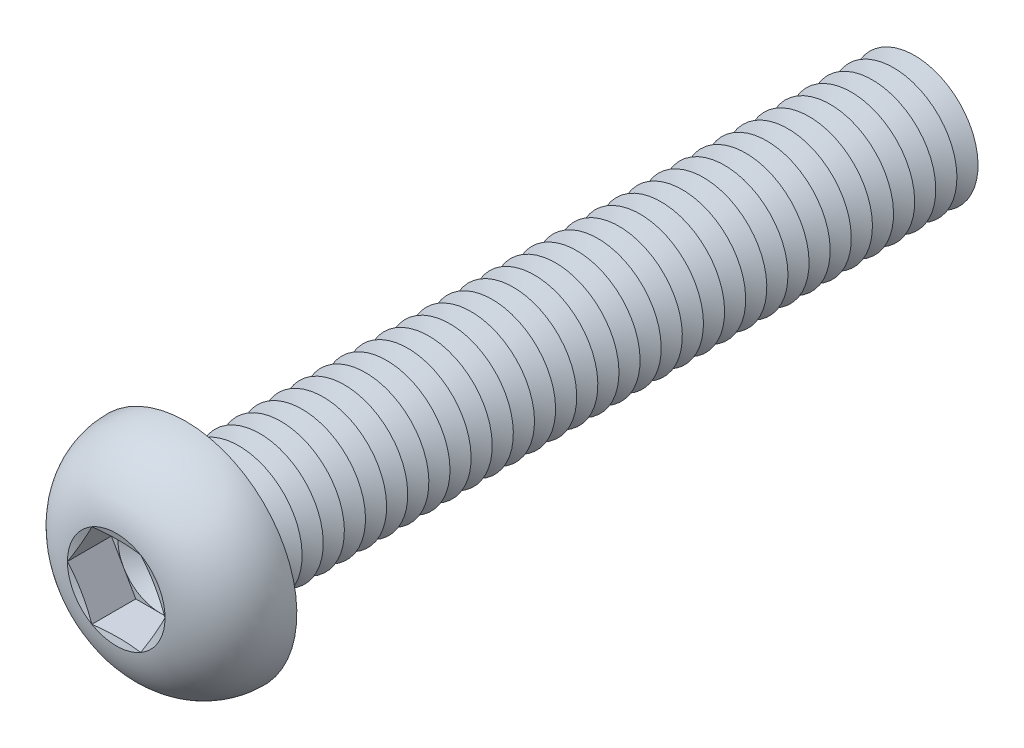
ISO-10303-21;
HEADER;
FILE_DESCRIPTION(('STEP AP214'),'2;1');
FILE_NAME('part.step','',(''),(''),'','','');
FILE_SCHEMA(('AUTOMOTIVE_DESIGN { 1 0 10303 214 1 1 1 1 }'));
ENDSEC;
DATA;
#1=APPLICATION_CONTEXT('core data for automotive mechanical design processes');
#2=APPLICATION_PROTOCOL_DEFINITION('international standard','automotive_design',2000,#1);
#3=PRODUCT_CONTEXT('',#1,'mechanical');
#4=PRODUCT('Part','Part','',(#3));
#5=PRODUCT_RELATED_PRODUCT_CATEGORY('part','',(#4));
#6=PRODUCT_DEFINITION_FORMATION('','',#4);
#7=PRODUCT_DEFINITION_CONTEXT('part definition',#1,'design');
#8=PRODUCT_DEFINITION('design','',#6,#7);
#9=PRODUCT_DEFINITION_SHAPE('','',#8);
#10=(LENGTH_UNIT() NAMED_UNIT(*) SI_UNIT(.MILLI.,.METRE.));
#11=(NAMED_UNIT(*) PLANE_ANGLE_UNIT() SI_UNIT($,.RADIAN.));
#12=(NAMED_UNIT(*) SI_UNIT($,.STERADIAN.) SOLID_ANGLE_UNIT());
#13=UNCERTAINTY_MEASURE_WITH_UNIT(LENGTH_MEASURE(1.E-05),#10,'distance_accuracy_value','');
#14=(GEOMETRIC_REPRESENTATION_CONTEXT(3) GLOBAL_UNCERTAINTY_ASSIGNED_CONTEXT((#13)) GLOBAL_UNIT_ASSIGNED_CONTEXT((#10,
#11,#12)) REPRESENTATION_CONTEXT('',''));
#15=CARTESIAN_POINT('',(0.,0.,0.));
#16=DIRECTION('',(0.,0.,1.));
#17=DIRECTION('',(1.,0.,0.));
#18=AXIS2_PLACEMENT_3D('',#15,#16,#17);
#19=CARTESIAN_POINT('',(0.,0.,1.22));
#20=DIRECTION('',(0.,0.,1.));
#21=DIRECTION('',(1.,0.,0.));
#22=AXIS2_PLACEMENT_3D('',#19,#20,#21);
#23=PLANE('',#22);
#24=CARTESIAN_POINT('',(0.,0.,1.22));
#25=DIRECTION('',(0.,0.,1.));
#26=DIRECTION('',(1.,0.,0.));
#27=AXIS2_PLACEMENT_3D('',#24,#25,#26);
#28=CIRCLE('',#27,1.99999906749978);
#29=CARTESIAN_POINT('',(1.73205,0.999999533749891,1.22));
#30=VERTEX_POINT('',#29);
#31=CARTESIAN_POINT('',(0.,1.99999906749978,1.22));
#32=VERTEX_POINT('',#31);
#33=EDGE_CURVE('E118',#30,#32,#28,.T.);
#34=ORIENTED_EDGE('',*,*,#33,.F.);
#35=DIRECTION('',(-0.5,0.866025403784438,0.));
#36=VECTOR('',#35,1.);
#37=CARTESIAN_POINT('',(2.3094,0.,1.22));
#38=LINE('',#37,#36);
#39=CARTESIAN_POINT('',(1.1547,1.99999906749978,1.22));
#40=VERTEX_POINT('',#39);
#41=EDGE_CURVE('E125',#30,#40,#38,.T.);
#42=ORIENTED_EDGE('',*,*,#41,.T.);
#43=DIRECTION('',(-1.,0.,0.));
#44=VECTOR('',#43,1.);
#45=CARTESIAN_POINT('',(1.1547,1.99999906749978,1.22));
#46=LINE('',#45,#44);
#47=EDGE_CURVE('E136',#40,#32,#46,.T.);
#48=ORIENTED_EDGE('',*,*,#47,.T.);
#49=EDGE_LOOP('',(#34,#42,#48));
#50=FACE_BOUND('',#49,.T.);
#51=ADVANCED_FACE('F39',(#50),#23,.T.);
#52=CARTESIAN_POINT('',(0.,0.,1.22));
#53=DIRECTION('',(0.,0.,1.));
#54=DIRECTION('',(1.,0.,0.));
#55=AXIS2_PLACEMENT_3D('',#52,#53,#54);
#56=CIRCLE('',#55,1.99999906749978);
#57=CARTESIAN_POINT('',(-1.73205,0.999999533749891,1.22));
#58=VERTEX_POINT('',#57);
#59=EDGE_CURVE('E11',#32,#58,#56,.T.);
#60=ORIENTED_EDGE('',*,*,#59,.F.);
#61=CARTESIAN_POINT('',(-1.1547,1.99999906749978,1.22));
#62=VERTEX_POINT('',#61);
#63=EDGE_CURVE('E131',#32,#62,#46,.T.);
#64=ORIENTED_EDGE('',*,*,#63,.T.);
#65=DIRECTION('',(-0.5,-0.866025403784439,0.));
#66=VECTOR('',#65,1.);
#67=CARTESIAN_POINT('',(-1.1547,1.99999906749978,1.22));
#68=LINE('',#67,#66);
#69=EDGE_CURVE('E134',#62,#58,#68,.T.);
#70=ORIENTED_EDGE('',*,*,#69,.T.);
#71=EDGE_LOOP('',(#60,#64,#70));
#72=FACE_BOUND('',#71,.T.);
#73=ADVANCED_FACE('F130',(#72),#23,.T.);
#74=CARTESIAN_POINT('',(-1.73205,-0.999999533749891,1.22));
#75=VERTEX_POINT('',#74);
#76=EDGE_CURVE('E49',#58,#75,#56,.T.);
#77=ORIENTED_EDGE('',*,*,#76,.F.);
#78=CARTESIAN_POINT('',(-2.3094,0.,1.22));
#79=VERTEX_POINT('',#78);
#80=EDGE_CURVE('E143',#58,#79,#68,.T.);
#81=ORIENTED_EDGE('',*,*,#80,.T.);
#82=DIRECTION('',(0.5,-0.866025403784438,0.));
#83=VECTOR('',#82,1.);
#84=CARTESIAN_POINT('',(-2.3094,0.,1.22));
#85=LINE('',#84,#83);
#86=EDGE_CURVE('E151',#79,#75,#85,.T.);
#87=ORIENTED_EDGE('',*,*,#86,.T.);
#88=EDGE_LOOP('',(#77,#81,#87));
#89=FACE_BOUND('',#88,.T.);
#90=ADVANCED_FACE('F547',(#89),#23,.T.);
#91=CARTESIAN_POINT('',(0.,-1.99999906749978,1.22));
#92=VERTEX_POINT('',#91);
#93=EDGE_CURVE('E530',#75,#92,#56,.T.);
#94=ORIENTED_EDGE('',*,*,#93,.F.);
#95=CARTESIAN_POINT('',(-1.1547,-1.99999906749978,1.22));
#96=VERTEX_POINT('',#95);
#97=EDGE_CURVE('E150',#75,#96,#85,.T.);
#98=ORIENTED_EDGE('',*,*,#97,.T.);
#99=DIRECTION('',(1.,0.,0.));
#100=VECTOR('',#99,1.);
#101=CARTESIAN_POINT('',(-1.1547,-1.99999906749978,1.22));
#102=LINE('',#101,#100);
#103=EDGE_CURVE('E156',#96,#92,#102,.T.);
#104=ORIENTED_EDGE('',*,*,#103,.T.);
#105=EDGE_LOOP('',(#94,#98,#104));
#106=FACE_BOUND('',#105,.T.);
#107=ADVANCED_FACE('F540',(#106),#23,.T.);
#108=CARTESIAN_POINT('',(1.73205,-0.999999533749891,1.22));
#109=VERTEX_POINT('',#108);
#110=EDGE_CURVE('E56',#92,#109,#56,.T.);
#111=ORIENTED_EDGE('',*,*,#110,.F.);
#112=CARTESIAN_POINT('',(1.1547,-1.99999906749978,1.22));
#113=VERTEX_POINT('',#112);
#114=EDGE_CURVE('E155',#92,#113,#102,.T.);
#115=ORIENTED_EDGE('',*,*,#114,.T.);
#116=DIRECTION('',(0.5,0.866025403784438,0.));
#117=VECTOR('',#116,1.);
#118=CARTESIAN_POINT('',(1.1547,-1.99999906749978,1.22));
#119=LINE('',#118,#117);
#120=EDGE_CURVE('E161',#113,#109,#119,.T.);
#121=ORIENTED_EDGE('',*,*,#120,.T.);
#122=EDGE_LOOP('',(#111,#115,#121));
#123=FACE_BOUND('',#122,.T.);
#124=ADVANCED_FACE('F616',(#123),#23,.T.);
#125=CARTESIAN_POINT('',(0.,0.,3.3));
#126=DIRECTION('',(0.,0.,1.));
#127=DIRECTION('',(0.,-1.,0.));
#128=AXIS2_PLACEMENT_3D('',#125,#126,#127);
#129=CONICAL_SURFACE('',#128,2.3094,1.30899693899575);
#130=CARTESIAN_POINT('',(2.30951547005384,-0.000200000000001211,3.30003094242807));
#131=CARTESIAN_POINT('',(2.26155412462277,0.082871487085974,3.2871729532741));
#132=CARTESIAN_POINT('',(2.21350580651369,0.166093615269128,3.27549992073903));
#133=CARTESIAN_POINT('',(2.11723944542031,0.332831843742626,3.2549913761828));
#134=CARTESIAN_POINT('',(2.06902134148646,0.416348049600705,3.24615701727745));
#135=CARTESIAN_POINT('',(1.97270782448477,0.583167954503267,3.23184167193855));
#136=CARTESIAN_POINT('',(1.92461306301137,0.666470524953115,3.22634360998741));
#137=CARTESIAN_POINT('',(1.82836219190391,0.833181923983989,3.21897125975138));
#138=CARTESIAN_POINT('',(1.78020609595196,0.916590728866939,3.21709626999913));
#139=CARTESIAN_POINT('',(1.68389390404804,1.08340833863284,3.21709626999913));
#140=CARTESIAN_POINT('',(1.63573780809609,1.16681714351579,3.21897125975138));
#141=CARTESIAN_POINT('',(1.53948693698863,1.33352854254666,3.22634360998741));
#142=CARTESIAN_POINT('',(1.49139217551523,1.41683111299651,3.23184167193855));
#143=CARTESIAN_POINT('',(1.39507865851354,1.58365101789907,3.24615701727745));
#144=CARTESIAN_POINT('',(1.34686055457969,1.66716722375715,3.2549913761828));
#145=CARTESIAN_POINT('',(1.25059419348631,1.83390545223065,3.27549992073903));
#146=CARTESIAN_POINT('',(1.20254587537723,1.9171275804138,3.2871729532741));
#147=CARTESIAN_POINT('',(1.15458452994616,2.00019906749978,3.30003094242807));
#148=B_SPLINE_CURVE_WITH_KNOTS('',3,(#130,#131,#132,#133,#134,#135,#136,#137,#138,#139,#140,
#141,#142,#143,#144,#145,#146,#147),.UNSPECIFIED.,.F.,.F.,(4,2,2,2,2,2,2,2,4),(0.,
0.290357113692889,0.580832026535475,0.869807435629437,1.15872689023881,1.44764634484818,
1.73662175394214,2.02709666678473,2.31745378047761),.UNSPECIFIED.);
#149=CARTESIAN_POINT('',(2.3094,0.,3.3));
#150=VERTEX_POINT('',#149);
#151=CARTESIAN_POINT('',(1.15469999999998,1.99999906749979,3.3));
#152=VERTEX_POINT('',#151);
#153=EDGE_CURVE('E220',#150,#152,#148,.T.);
#154=ORIENTED_EDGE('',*,*,#153,.F.);
#155=CARTESIAN_POINT('',(0.,0.,3.3));
#156=DIRECTION('',(0.,0.,-1.));
#157=DIRECTION('',(0.,1.,0.));
#158=AXIS2_PLACEMENT_3D('',#155,#156,#157);
#159=CIRCLE('',#158,2.3094);
#160=EDGE_CURVE('E516',#152,#150,#159,.T.);
#161=ORIENTED_EDGE('',*,*,#160,.F.);
#162=EDGE_LOOP('',(#154,#161));
#163=FACE_BOUND('',#162,.T.);
#164=ADVANCED_FACE('F620',(#163),#129,.F.);
#165=CARTESIAN_POINT('',(1.15458452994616,-2.00019906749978,3.30003094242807));
#166=CARTESIAN_POINT('',(1.20254587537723,-1.91712758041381,3.2871729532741));
#167=CARTESIAN_POINT('',(1.25059419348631,-1.83390545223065,3.27549992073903));
#168=CARTESIAN_POINT('',(1.34686055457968,-1.66716722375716,3.2549913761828));
#169=CARTESIAN_POINT('',(1.39507865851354,-1.58365101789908,3.24615701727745));
#170=CARTESIAN_POINT('',(1.49139217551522,-1.41683111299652,3.23184167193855));
#171=CARTESIAN_POINT('',(1.53948693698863,-1.33352854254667,3.22634360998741));
#172=CARTESIAN_POINT('',(1.63573780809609,-1.16681714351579,3.21897125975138));
#173=CARTESIAN_POINT('',(1.68389390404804,-1.08340833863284,3.21709626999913));
#174=CARTESIAN_POINT('',(1.78020609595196,-0.916590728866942,3.21709626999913));
#175=CARTESIAN_POINT('',(1.82836219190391,-0.833181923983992,3.21897125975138));
#176=CARTESIAN_POINT('',(1.92461306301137,-0.666470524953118,3.22634360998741));
#177=CARTESIAN_POINT('',(1.97270782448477,-0.58316795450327,3.23184167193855));
#178=CARTESIAN_POINT('',(2.06902134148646,-0.416348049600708,3.24615701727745));
#179=CARTESIAN_POINT('',(2.11723944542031,-0.332831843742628,3.2549913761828));
#180=CARTESIAN_POINT('',(2.21350580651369,-0.16609361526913,3.27549992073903));
#181=CARTESIAN_POINT('',(2.26155412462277,-0.0828714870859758,3.2871729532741));
#182=CARTESIAN_POINT('',(2.30951547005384,0.000199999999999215,3.30003094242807));
#183=B_SPLINE_CURVE_WITH_KNOTS('',3,(#165,#166,#167,#168,#169,#170,#171,#172,#173,#174,#175,
#176,#177,#178,#179,#180,#181,#182),.UNSPECIFIED.,.F.,.F.,(4,2,2,2,2,2,2,2,4),(0.,
0.290357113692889,0.580832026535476,0.869807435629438,1.15872689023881,1.44764634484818,
1.73662175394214,2.02709666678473,2.31745378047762),.UNSPECIFIED.);
#184=CARTESIAN_POINT('',(1.1547,-1.99999906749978,3.3));
#185=VERTEX_POINT('',#184);
#186=EDGE_CURVE('E229',#185,#150,#183,.T.);
#187=ORIENTED_EDGE('',*,*,#186,.F.);
#188=EDGE_CURVE('E521',#150,#185,#159,.T.);
#189=ORIENTED_EDGE('',*,*,#188,.F.);
#190=EDGE_LOOP('',(#187,#189));
#191=FACE_BOUND('',#190,.T.);
#192=ADVANCED_FACE('F581',(#191),#129,.F.);
#193=CARTESIAN_POINT('',(-3.4849337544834,-1.99999906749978,3.75783251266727));
#194=CARTESIAN_POINT('',(-3.40057136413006,-1.99999906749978,3.73822859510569));
#195=CARTESIAN_POINT('',(-3.31617090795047,-1.99999906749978,3.71878852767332));
#196=CARTESIAN_POINT('',(-3.14727791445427,-1.99999906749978,3.68030638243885));
#197=CARTESIAN_POINT('',(-3.06278537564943,-1.99999906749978,3.66126431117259));
#198=CARTESIAN_POINT('',(-2.80911712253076,-1.99999906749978,3.60483420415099));
#199=CARTESIAN_POINT('',(-2.63978343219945,-1.99999906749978,3.5681499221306));
#200=CARTESIAN_POINT('',(-2.29895421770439,-1.99999906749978,3.49717072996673));
#201=CARTESIAN_POINT('',(-2.12745330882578,-1.99999906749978,3.4629014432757));
#202=CARTESIAN_POINT('',(-1.78364663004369,-1.99999906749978,3.39849485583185));
#203=CARTESIAN_POINT('',(-1.61134079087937,-1.99999906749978,3.36835791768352));
#204=CARTESIAN_POINT('',(-1.27040784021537,-1.99999906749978,3.31501553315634));
#205=CARTESIAN_POINT('',(-1.10180724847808,-1.99999906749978,3.291644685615));
#206=CARTESIAN_POINT('',(-0.763641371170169,-1.99999906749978,3.2533727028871));
#207=CARTESIAN_POINT('',(-0.594076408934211,-1.99999906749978,3.23846888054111));
#208=CARTESIAN_POINT('',(-0.339649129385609,-1.99999906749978,3.22431372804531));
#209=CARTESIAN_POINT('',(-0.255009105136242,-1.99999906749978,3.22096057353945));
#210=CARTESIAN_POINT('',(-0.0856618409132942,-1.99999906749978,3.21711210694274));
#211=CARTESIAN_POINT('',(-0.000954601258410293,-1.99999906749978,3.2166167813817));
#212=CARTESIAN_POINT('',(0.16843098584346,-1.99999906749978,3.21851478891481));
#213=CARTESIAN_POINT('',(0.253109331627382,-1.99999906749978,3.2209082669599));
#214=CARTESIAN_POINT('',(0.422344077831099,-1.99999906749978,3.22845792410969));
#215=CARTESIAN_POINT('',(0.506900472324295,-1.99999906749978,3.23361423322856));
#216=CARTESIAN_POINT('',(0.712240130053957,-1.99999906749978,3.24921577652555));
#217=CARTESIAN_POINT('',(0.832922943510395,-1.99999906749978,3.26098285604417));
#218=CARTESIAN_POINT('',(1.07378161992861,-1.99999906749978,3.28874908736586));
#219=CARTESIAN_POINT('',(1.1939575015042,-1.99999906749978,3.30474808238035));
#220=CARTESIAN_POINT('',(1.43419655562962,-1.99999906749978,3.34009172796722));
#221=CARTESIAN_POINT('',(1.55425817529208,-1.99999906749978,3.35944677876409));
#222=CARTESIAN_POINT('',(1.79394991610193,-1.99999906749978,3.40067076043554));
#223=CARTESIAN_POINT('',(1.91358001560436,-1.99999906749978,3.42253981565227));
#224=CARTESIAN_POINT('',(2.15493405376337,-1.99999906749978,3.46864194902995));
#225=CARTESIAN_POINT('',(2.27665041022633,-1.99999906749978,3.49291441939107));
#226=CARTESIAN_POINT('',(2.51977680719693,-1.99999906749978,3.54294628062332));
#227=CARTESIAN_POINT('',(2.64118684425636,-1.99999906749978,3.56870568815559));
#228=CARTESIAN_POINT('',(2.88310060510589,-1.99999906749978,3.62120891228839));
#229=CARTESIAN_POINT('',(3.00360566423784,-1.99999906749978,3.6479466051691));
#230=CARTESIAN_POINT('',(3.24441021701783,-1.99999906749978,3.7022947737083));
#231=CARTESIAN_POINT('',(3.36470972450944,-1.99999906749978,3.72990518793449));
#232=CARTESIAN_POINT('',(3.4849337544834,-1.99999906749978,3.75783251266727));
#233=B_SPLINE_CURVE_WITH_KNOTS('',3,(#193,#194,#195,#196,#197,#198,#199,#200,#201,#202,#203,
#204,#205,#206,#207,#208,#209,#210,#211,#212,#213,#214,#215,#216,#217,#218,#219,#220,#221,#222,
#223,#224,#225,#226,#227,#228,#229,#230,#231,#232),.UNSPECIFIED.,.F.,.F.,(4,2,2,2,2,2,2,2,2,2,2,
2,2,2,2,2,2,2,2,4),(0.,0.259830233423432,0.519664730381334,1.03943435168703,1.56407662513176,
2.08876490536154,2.59926476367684,3.10960251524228,3.36367930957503,3.61775490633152,
3.87184325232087,4.1259435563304,4.48960924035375,4.85326145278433,5.21806142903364,
5.58287945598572,5.95520617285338,6.32753706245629,6.69784064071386,7.06811821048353),.UNSPECIFIED.);
#234=CARTESIAN_POINT('',(-1.1547,-1.99999906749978,3.3));
#235=VERTEX_POINT('',#234);
#236=EDGE_CURVE('E561',#235,#185,#233,.T.);
#237=ORIENTED_EDGE('',*,*,#236,.F.);
#238=EDGE_CURVE('E574',#185,#235,#159,.T.);
#239=ORIENTED_EDGE('',*,*,#238,.F.);
#240=EDGE_LOOP('',(#237,#239));
#241=FACE_BOUND('',#240,.T.);
#242=ADVANCED_FACE('F587',(#241),#129,.F.);
#243=CARTESIAN_POINT('',(-2.30951547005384,0.000199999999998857,3.30003094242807));
#244=CARTESIAN_POINT('',(-2.26155412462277,-0.0828714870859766,3.2871729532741));
#245=CARTESIAN_POINT('',(-2.21350580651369,-0.166093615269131,3.27549992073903));
#246=CARTESIAN_POINT('',(-2.11723944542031,-0.332831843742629,3.2549913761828));
#247=CARTESIAN_POINT('',(-2.06902134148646,-0.416348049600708,3.24615701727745));
#248=CARTESIAN_POINT('',(-1.97270782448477,-0.58316795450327,3.23184167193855));
#249=CARTESIAN_POINT('',(-1.92461306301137,-0.666470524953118,3.22634360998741));
#250=CARTESIAN_POINT('',(-1.82836219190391,-0.833181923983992,3.21897125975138));
#251=CARTESIAN_POINT('',(-1.78020609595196,-0.916590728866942,3.21709626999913));
#252=CARTESIAN_POINT('',(-1.68389390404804,-1.08340833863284,3.21709626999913));
#253=CARTESIAN_POINT('',(-1.63573780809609,-1.16681714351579,3.21897125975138));
#254=CARTESIAN_POINT('',(-1.53948693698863,-1.33352854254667,3.22634360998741));
#255=CARTESIAN_POINT('',(-1.49139217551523,-1.41683111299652,3.23184167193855));
#256=CARTESIAN_POINT('',(-1.39507865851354,-1.58365101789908,3.24615701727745));
#257=CARTESIAN_POINT('',(-1.34686055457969,-1.66716722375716,3.2549913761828));
#258=CARTESIAN_POINT('',(-1.25059419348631,-1.83390545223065,3.27549992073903));
#259=CARTESIAN_POINT('',(-1.20254587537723,-1.91712758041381,3.2871729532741));
#260=CARTESIAN_POINT('',(-1.15458452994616,-2.00019906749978,3.30003094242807));
#261=B_SPLINE_CURVE_WITH_KNOTS('',3,(#243,#244,#245,#246,#247,#248,#249,#250,#251,#252,#253,
#254,#255,#256,#257,#258,#259,#260),.UNSPECIFIED.,.F.,.F.,(4,2,2,2,2,2,2,2,4),(0.,
0.290357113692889,0.580832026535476,0.869807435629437,1.15872689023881,1.44764634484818,
1.73662175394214,2.02709666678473,2.31745378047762),.UNSPECIFIED.);
#262=CARTESIAN_POINT('',(-2.3094,0.,3.3));
#263=VERTEX_POINT('',#262);
#264=EDGE_CURVE('E552',#263,#235,#261,.T.);
#265=ORIENTED_EDGE('',*,*,#264,.F.);
#266=EDGE_CURVE('E558',#235,#263,#159,.T.);
#267=ORIENTED_EDGE('',*,*,#266,.F.);
#268=EDGE_LOOP('',(#265,#267));
#269=FACE_BOUND('',#268,.T.);
#270=ADVANCED_FACE('F556',(#269),#129,.F.);
#271=CARTESIAN_POINT('',(-1.15458452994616,2.00019906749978,3.30003094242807));
#272=CARTESIAN_POINT('',(-1.20254587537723,1.9171275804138,3.2871729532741));
#273=CARTESIAN_POINT('',(-1.25059419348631,1.83390545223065,3.27549992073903));
#274=CARTESIAN_POINT('',(-1.34686055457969,1.66716722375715,3.2549913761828));
#275=CARTESIAN_POINT('',(-1.39507865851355,1.58365101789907,3.24615701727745));
#276=CARTESIAN_POINT('',(-1.49139217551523,1.41683111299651,3.23184167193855));
#277=CARTESIAN_POINT('',(-1.53948693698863,1.33352854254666,3.22634360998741));
#278=CARTESIAN_POINT('',(-1.63573780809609,1.16681714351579,3.21897125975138));
#279=CARTESIAN_POINT('',(-1.68389390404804,1.08340833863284,3.21709626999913));
#280=CARTESIAN_POINT('',(-1.78020609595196,0.916590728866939,3.21709626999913));
#281=CARTESIAN_POINT('',(-1.82836219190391,0.833181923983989,3.21897125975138));
#282=CARTESIAN_POINT('',(-1.92461306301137,0.666470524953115,3.22634360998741));
#283=CARTESIAN_POINT('',(-1.97270782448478,0.583167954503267,3.23184167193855));
#284=CARTESIAN_POINT('',(-2.06902134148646,0.416348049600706,3.24615701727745));
#285=CARTESIAN_POINT('',(-2.11723944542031,0.332831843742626,3.2549913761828));
#286=CARTESIAN_POINT('',(-2.21350580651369,0.166093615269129,3.27549992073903));
#287=CARTESIAN_POINT('',(-2.26155412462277,0.0828714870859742,3.2871729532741));
#288=CARTESIAN_POINT('',(-2.30951547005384,-0.000200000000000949,3.30003094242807));
#289=B_SPLINE_CURVE_WITH_KNOTS('',3,(#271,#272,#273,#274,#275,#276,#277,#278,#279,#280,#281,
#282,#283,#284,#285,#286,#287,#288),.UNSPECIFIED.,.F.,.F.,(4,2,2,2,2,2,2,2,4),(0.,
0.290357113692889,0.580832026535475,0.869807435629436,1.15872689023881,1.44764634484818,
1.73662175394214,2.02709666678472,2.31745378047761),.UNSPECIFIED.);
#290=CARTESIAN_POINT('',(-1.1547,1.99999906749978,3.3));
#291=VERTEX_POINT('',#290);
#292=EDGE_CURVE('E194',#291,#263,#289,.T.);
#293=ORIENTED_EDGE('',*,*,#292,.F.);
#294=EDGE_CURVE('E564',#263,#291,#159,.T.);
#295=ORIENTED_EDGE('',*,*,#294,.F.);
#296=EDGE_LOOP('',(#293,#295));
#297=FACE_BOUND('',#296,.T.);
#298=ADVANCED_FACE('F565',(#297),#129,.F.);
#299=CARTESIAN_POINT('',(0.,0.,-31.5));
#300=DIRECTION('',(0.,0.,1.));
#301=DIRECTION('',(0.,-1.,0.));
#302=AXIS2_PLACEMENT_3D('',#299,#300,#301);
#303=CONICAL_SURFACE('',#302,2.99999999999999,1.0471975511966);
#304=CARTESIAN_POINT('',(0.,0.,-32.));
#305=DIRECTION('',(0.,0.,1.));
#306=DIRECTION('',(0.,-1.,0.));
#307=AXIS2_PLACEMENT_3D('',#304,#305,#306);
#308=CIRCLE('',#307,2.13397459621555);
#309=CARTESIAN_POINT('',(0.,-2.13397459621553,-32.));
#310=VERTEX_POINT('',#309);
#311=EDGE_CURVE('E487',#310,#310,#308,.T.);
#312=ORIENTED_EDGE('',*,*,#311,.T.);
#313=EDGE_LOOP('',(#312));
#314=FACE_BOUND('',#313,.T.);
#315=CARTESIAN_POINT('',(0.,0.,-31.5));
#316=DIRECTION('',(0.,0.,1.));
#317=DIRECTION('',(0.,-1.,0.));
#318=AXIS2_PLACEMENT_3D('',#315,#316,#317);
#319=CIRCLE('',#318,2.99999999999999);
#320=CARTESIAN_POINT('',(0.,-2.99999999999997,-31.5));
#321=VERTEX_POINT('',#320);
#322=EDGE_CURVE('E483',#321,#321,#319,.T.);
#323=ORIENTED_EDGE('',*,*,#322,.F.);
#324=EDGE_LOOP('',(#323));
#325=FACE_BOUND('',#324,.T.);
#326=ADVANCED_FACE('F648',(#314,#325),#303,.T.);
#327=CARTESIAN_POINT('',(0.,0.,-32.));
#328=DIRECTION('',(0.,0.,-1.));
#329=DIRECTION('',(0.,1.,0.));
#330=AXIS2_PLACEMENT_3D('',#327,#328,#329);
#331=CONICAL_SURFACE('',#330,2.13397459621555,1.0471975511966);
#332=CARTESIAN_POINT('',(0.,0.,-32.5));
#333=DIRECTION('',(0.,0.,1.));
#334=DIRECTION('',(0.,-1.,0.));
#335=AXIS2_PLACEMENT_3D('',#332,#333,#334);
#336=CIRCLE('',#335,2.99999999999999);
#337=CARTESIAN_POINT('',(0.,-2.99999999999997,-32.5));
#338=VERTEX_POINT('',#337);
#339=EDGE_CURVE('E491',#338,#338,#336,.T.);
#340=ORIENTED_EDGE('',*,*,#339,.T.);
#341=EDGE_LOOP('',(#340));
#342=FACE_BOUND('',#341,.T.);
#343=ORIENTED_EDGE('',*,*,#311,.F.);
#344=EDGE_LOOP('',(#343));
#345=FACE_BOUND('',#344,.T.);
#346=ADVANCED_FACE('F653',(#342,#345),#331,.T.);
#347=CARTESIAN_POINT('',(0.,3.,-35.));
#348=DIRECTION('',(0.,0.,-1.));
#349=DIRECTION('',(0.,1.,0.));
#350=AXIS2_PLACEMENT_3D('',#347,#348,#349);
#351=PLANE('',#350);
#352=CARTESIAN_POINT('',(0.,0.,-35.));
#353=DIRECTION('',(0.,0.,1.));
#354=DIRECTION('',(0.,-1.,0.));
#355=AXIS2_PLACEMENT_3D('',#352,#353,#354);
#356=CIRCLE('',#355,2.13397459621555);
#357=CARTESIAN_POINT('',(0.,-2.13397459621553,-35.));
#358=VERTEX_POINT('',#357);
#359=EDGE_CURVE('E511',#358,#358,#356,.T.);
#360=ORIENTED_EDGE('',*,*,#359,.F.);
#361=EDGE_LOOP('',(#360));
#362=FACE_BOUND('',#361,.T.);
#363=ADVANCED_FACE('F820',(#362),#351,.T.);
#364=CARTESIAN_POINT('',(0.,0.,-34.5));
#365=DIRECTION('',(0.,0.,1.));
#366=DIRECTION('',(0.,-1.,0.));
#367=AXIS2_PLACEMENT_3D('',#364,#365,#366);
#368=CONICAL_SURFACE('',#367,2.99999999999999,1.0471975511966);
#369=ORIENTED_EDGE('',*,*,#359,.T.);
#370=EDGE_LOOP('',(#369));
#371=FACE_BOUND('',#370,.T.);
#372=CARTESIAN_POINT('',(0.,0.,-34.5));
#373=DIRECTION('',(0.,0.,1.));
#374=DIRECTION('',(0.,-1.,0.));
#375=AXIS2_PLACEMENT_3D('',#372,#373,#374);
#376=CIRCLE('',#375,2.99999999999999);
#377=CARTESIAN_POINT('',(0.,-2.99999999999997,-34.5));
#378=VERTEX_POINT('',#377);
#379=EDGE_CURVE('E507',#378,#378,#376,.T.);
#380=ORIENTED_EDGE('',*,*,#379,.F.);
#381=EDGE_LOOP('',(#380));
#382=FACE_BOUND('',#381,.T.);
#383=ADVANCED_FACE('F813',(#371,#382),#368,.T.);
#384=CARTESIAN_POINT('',(0.,0.,-34.));
#385=DIRECTION('',(0.,0.,-1.));
#386=DIRECTION('',(0.,1.,0.));
#387=AXIS2_PLACEMENT_3D('',#384,#385,#386);
#388=CONICAL_SURFACE('',#387,2.13397459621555,1.0471975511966);
#389=ORIENTED_EDGE('',*,*,#379,.T.);
#390=EDGE_LOOP('',(#389));
#391=FACE_BOUND('',#390,.T.);
#392=CARTESIAN_POINT('',(0.,0.,-34.));
#393=DIRECTION('',(0.,0.,1.));
#394=DIRECTION('',(0.,-1.,0.));
#395=AXIS2_PLACEMENT_3D('',#392,#393,#394);
#396=CIRCLE('',#395,2.13397459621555);
#397=CARTESIAN_POINT('',(0.,-2.13397459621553,-34.));
#398=VERTEX_POINT('',#397);
#399=EDGE_CURVE('E503',#398,#398,#396,.T.);
#400=ORIENTED_EDGE('',*,*,#399,.F.);
#401=EDGE_LOOP('',(#400));
#402=FACE_BOUND('',#401,.T.);
#403=ADVANCED_FACE('F819',(#391,#402),#388,.T.);
#404=CARTESIAN_POINT('',(0.,0.,-33.5));
#405=DIRECTION('',(0.,0.,1.));
#406=DIRECTION('',(0.,-1.,0.));
#407=AXIS2_PLACEMENT_3D('',#404,#405,#406);
#408=CONICAL_SURFACE('',#407,2.99999999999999,1.0471975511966);
#409=ORIENTED_EDGE('',*,*,#399,.T.);
#410=EDGE_LOOP('',(#409));
#411=FACE_BOUND('',#410,.T.);
#412=CARTESIAN_POINT('',(0.,0.,-33.5));
#413=DIRECTION('',(0.,0.,1.));
#414=DIRECTION('',(0.,-1.,0.));
#415=AXIS2_PLACEMENT_3D('',#412,#413,#414);
#416=CIRCLE('',#415,2.99999999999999);
#417=CARTESIAN_POINT('',(0.,-2.99999999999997,-33.5));
#418=VERTEX_POINT('',#417);
#419=EDGE_CURVE('E499',#418,#418,#416,.T.);
#420=ORIENTED_EDGE('',*,*,#419,.F.);
#421=EDGE_LOOP('',(#420));
#422=FACE_BOUND('',#421,.T.);
#423=ADVANCED_FACE('F851',(#411,#422),#408,.T.);
#424=CARTESIAN_POINT('',(0.,0.,-33.));
#425=DIRECTION('',(0.,0.,-1.));
#426=DIRECTION('',(0.,1.,0.));
#427=AXIS2_PLACEMENT_3D('',#424,#425,#426);
#428=CONICAL_SURFACE('',#427,2.13397459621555,1.0471975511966);
#429=ORIENTED_EDGE('',*,*,#419,.T.);
#430=EDGE_LOOP('',(#429));
#431=FACE_BOUND('',#430,.T.);
#432=CARTESIAN_POINT('',(0.,0.,-33.));
#433=DIRECTION('',(0.,0.,1.));
#434=DIRECTION('',(0.,-1.,0.));
#435=AXIS2_PLACEMENT_3D('',#432,#433,#434);
#436=CIRCLE('',#435,2.13397459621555);
#437=CARTESIAN_POINT('',(0.,-2.13397459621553,-33.));
#438=VERTEX_POINT('',#437);
#439=EDGE_CURVE('E495',#438,#438,#436,.T.);
#440=ORIENTED_EDGE('',*,*,#439,.F.);
#441=EDGE_LOOP('',(#440));
#442=FACE_BOUND('',#441,.T.);
#443=ADVANCED_FACE('F861',(#431,#442),#428,.T.);
#444=CARTESIAN_POINT('',(0.,0.,-32.5));
#445=DIRECTION('',(0.,0.,1.));
#446=DIRECTION('',(0.,-1.,0.));
#447=AXIS2_PLACEMENT_3D('',#444,#445,#446);
#448=CONICAL_SURFACE('',#447,2.99999999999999,1.0471975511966);
#449=ORIENTED_EDGE('',*,*,#439,.T.);
#450=EDGE_LOOP('',(#449));
#451=FACE_BOUND('',#450,.T.);
#452=ORIENTED_EDGE('',*,*,#339,.F.);
#453=EDGE_LOOP('',(#452));
#454=FACE_BOUND('',#453,.T.);
#455=ADVANCED_FACE('F871',(#451,#454),#448,.T.);
#456=CARTESIAN_POINT('',(0.,0.,-30.5));
#457=DIRECTION('',(0.,0.,1.));
#458=DIRECTION('',(0.,-1.,0.));
#459=AXIS2_PLACEMENT_3D('',#456,#457,#458);
#460=CONICAL_SURFACE('',#459,2.99999999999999,1.0471975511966);
#461=CARTESIAN_POINT('',(0.,0.,-31.));
#462=DIRECTION('',(0.,0.,1.));
#463=DIRECTION('',(0.,-1.,0.));
#464=AXIS2_PLACEMENT_3D('',#461,#462,#463);
#465=CIRCLE('',#464,2.13397459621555);
#466=CARTESIAN_POINT('',(0.,-2.13397459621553,-31.));
#467=VERTEX_POINT('',#466);
#468=EDGE_CURVE('E479',#467,#467,#465,.T.);
#469=ORIENTED_EDGE('',*,*,#468,.T.);
#470=EDGE_LOOP('',(#469));
#471=FACE_BOUND('',#470,.T.);
#472=CARTESIAN_POINT('',(0.,0.,-30.5));
#473=DIRECTION('',(0.,0.,1.));
#474=DIRECTION('',(0.,-1.,0.));
#475=AXIS2_PLACEMENT_3D('',#472,#473,#474);
#476=CIRCLE('',#475,2.99999999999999);
#477=CARTESIAN_POINT('',(0.,-2.99999999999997,-30.5));
#478=VERTEX_POINT('',#477);
#479=EDGE_CURVE('E475',#478,#478,#476,.T.);
#480=ORIENTED_EDGE('',*,*,#479,.F.);
#481=EDGE_LOOP('',(#480));
#482=FACE_BOUND('',#481,.T.);
#483=ADVANCED_FACE('F881',(#471,#482),#460,.T.);
#484=CARTESIAN_POINT('',(0.,0.,-31.));
#485=DIRECTION('',(0.,0.,-1.));
#486=DIRECTION('',(0.,1.,0.));
#487=AXIS2_PLACEMENT_3D('',#484,#485,#486);
#488=CONICAL_SURFACE('',#487,2.13397459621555,1.0471975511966);
#489=ORIENTED_EDGE('',*,*,#322,.T.);
#490=EDGE_LOOP('',(#489));
#491=FACE_BOUND('',#490,.T.);
#492=ORIENTED_EDGE('',*,*,#468,.F.);
#493=EDGE_LOOP('',(#492));
#494=FACE_BOUND('',#493,.T.);
#495=ADVANCED_FACE('F891',(#491,#494),#488,.T.);
#496=CARTESIAN_POINT('',(0.,0.,-29.5));
#497=DIRECTION('',(0.,0.,1.));
#498=DIRECTION('',(0.,-1.,0.));
#499=AXIS2_PLACEMENT_3D('',#496,#497,#498);
#500=CONICAL_SURFACE('',#499,2.99999999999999,1.0471975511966);
#501=CARTESIAN_POINT('',(0.,0.,-30.));
#502=DIRECTION('',(0.,0.,1.));
#503=DIRECTION('',(0.,-1.,0.));
#504=AXIS2_PLACEMENT_3D('',#501,#502,#503);
#505=CIRCLE('',#504,2.13397459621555);
#506=CARTESIAN_POINT('',(0.,-2.13397459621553,-30.));
#507=VERTEX_POINT('',#506);
#508=EDGE_CURVE('E471',#507,#507,#505,.T.);
#509=ORIENTED_EDGE('',*,*,#508,.T.);
#510=EDGE_LOOP('',(#509));
#511=FACE_BOUND('',#510,.T.);
#512=CARTESIAN_POINT('',(0.,0.,-29.5));
#513=DIRECTION('',(0.,0.,1.));
#514=DIRECTION('',(0.,-1.,0.));
#515=AXIS2_PLACEMENT_3D('',#512,#513,#514);
#516=CIRCLE('',#515,2.99999999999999);
#517=CARTESIAN_POINT('',(0.,-2.99999999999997,-29.5));
#518=VERTEX_POINT('',#517);
#519=EDGE_CURVE('E467',#518,#518,#516,.T.);
#520=ORIENTED_EDGE('',*,*,#519,.F.);
#521=EDGE_LOOP('',(#520));
#522=FACE_BOUND('',#521,.T.);
#523=ADVANCED_FACE('F901',(#511,#522),#500,.T.);
#524=CARTESIAN_POINT('',(0.,0.,-30.));
#525=DIRECTION('',(0.,0.,-1.));
#526=DIRECTION('',(0.,1.,0.));
#527=AXIS2_PLACEMENT_3D('',#524,#525,#526);
#528=CONICAL_SURFACE('',#527,2.13397459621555,1.0471975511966);
#529=ORIENTED_EDGE('',*,*,#479,.T.);
#530=EDGE_LOOP('',(#529));
#531=FACE_BOUND('',#530,.T.);
#532=ORIENTED_EDGE('',*,*,#508,.F.);
#533=EDGE_LOOP('',(#532));
#534=FACE_BOUND('',#533,.T.);
#535=ADVANCED_FACE('F911',(#531,#534),#528,.T.);
#536=CARTESIAN_POINT('',(0.,0.,-28.5));
#537=DIRECTION('',(0.,0.,1.));
#538=DIRECTION('',(0.,-1.,0.));
#539=AXIS2_PLACEMENT_3D('',#536,#537,#538);
#540=CONICAL_SURFACE('',#539,2.99999999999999,1.0471975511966);
#541=CARTESIAN_POINT('',(0.,0.,-29.));
#542=DIRECTION('',(0.,0.,1.));
#543=DIRECTION('',(0.,-1.,0.));
#544=AXIS2_PLACEMENT_3D('',#541,#542,#543);
#545=CIRCLE('',#544,2.13397459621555);
#546=CARTESIAN_POINT('',(0.,-2.13397459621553,-29.));
#547=VERTEX_POINT('',#546);
#548=EDGE_CURVE('E463',#547,#547,#545,.T.);
#549=ORIENTED_EDGE('',*,*,#548,.T.);
#550=EDGE_LOOP('',(#549));
#551=FACE_BOUND('',#550,.T.);
#552=CARTESIAN_POINT('',(0.,0.,-28.5));
#553=DIRECTION('',(0.,0.,1.));
#554=DIRECTION('',(0.,-1.,0.));
#555=AXIS2_PLACEMENT_3D('',#552,#553,#554);
#556=CIRCLE('',#555,2.99999999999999);
#557=CARTESIAN_POINT('',(0.,-2.99999999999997,-28.5));
#558=VERTEX_POINT('',#557);
#559=EDGE_CURVE('E459',#558,#558,#556,.T.);
#560=ORIENTED_EDGE('',*,*,#559,.F.);
#561=EDGE_LOOP('',(#560));
#562=FACE_BOUND('',#561,.T.);
#563=ADVANCED_FACE('F921',(#551,#562),#540,.T.);
#564=CARTESIAN_POINT('',(0.,0.,-29.));
#565=DIRECTION('',(0.,0.,-1.));
#566=DIRECTION('',(0.,1.,0.));
#567=AXIS2_PLACEMENT_3D('',#564,#565,#566);
#568=CONICAL_SURFACE('',#567,2.13397459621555,1.0471975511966);
#569=ORIENTED_EDGE('',*,*,#519,.T.);
#570=EDGE_LOOP('',(#569));
#571=FACE_BOUND('',#570,.T.);
#572=ORIENTED_EDGE('',*,*,#548,.F.);
#573=EDGE_LOOP('',(#572));
#574=FACE_BOUND('',#573,.T.);
#575=ADVANCED_FACE('F931',(#571,#574),#568,.T.);
#576=CARTESIAN_POINT('',(0.,0.,-27.5));
#577=DIRECTION('',(0.,0.,1.));
#578=DIRECTION('',(0.,-1.,0.));
#579=AXIS2_PLACEMENT_3D('',#576,#577,#578);
#580=CONICAL_SURFACE('',#579,2.99999999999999,1.0471975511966);
#581=CARTESIAN_POINT('',(0.,0.,-28.));
#582=DIRECTION('',(0.,0.,1.));
#583=DIRECTION('',(0.,-1.,0.));
#584=AXIS2_PLACEMENT_3D('',#581,#582,#583);
#585=CIRCLE('',#584,2.13397459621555);
#586=CARTESIAN_POINT('',(0.,-2.13397459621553,-28.));
#587=VERTEX_POINT('',#586);
#588=EDGE_CURVE('E455',#587,#587,#585,.T.);
#589=ORIENTED_EDGE('',*,*,#588,.T.);
#590=EDGE_LOOP('',(#589));
#591=FACE_BOUND('',#590,.T.);
#592=CARTESIAN_POINT('',(0.,0.,-27.5));
#593=DIRECTION('',(0.,0.,1.));
#594=DIRECTION('',(0.,-1.,0.));
#595=AXIS2_PLACEMENT_3D('',#592,#593,#594);
#596=CIRCLE('',#595,2.99999999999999);
#597=CARTESIAN_POINT('',(0.,-2.99999999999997,-27.5));
#598=VERTEX_POINT('',#597);
#599=EDGE_CURVE('E451',#598,#598,#596,.T.);
#600=ORIENTED_EDGE('',*,*,#599,.F.);
#601=EDGE_LOOP('',(#600));
#602=FACE_BOUND('',#601,.T.);
#603=ADVANCED_FACE('F941',(#591,#602),#580,.T.);
#604=CARTESIAN_POINT('',(0.,0.,-28.));
#605=DIRECTION('',(0.,0.,-1.));
#606=DIRECTION('',(0.,1.,0.));
#607=AXIS2_PLACEMENT_3D('',#604,#605,#606);
#608=CONICAL_SURFACE('',#607,2.13397459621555,1.0471975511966);
#609=ORIENTED_EDGE('',*,*,#559,.T.);
#610=EDGE_LOOP('',(#609));
#611=FACE_BOUND('',#610,.T.);
#612=ORIENTED_EDGE('',*,*,#588,.F.);
#613=EDGE_LOOP('',(#612));
#614=FACE_BOUND('',#613,.T.);
#615=ADVANCED_FACE('F951',(#611,#614),#608,.T.);
#616=CARTESIAN_POINT('',(0.,0.,-26.5));
#617=DIRECTION('',(0.,0.,1.));
#618=DIRECTION('',(0.,-1.,0.));
#619=AXIS2_PLACEMENT_3D('',#616,#617,#618);
#620=CONICAL_SURFACE('',#619,2.99999999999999,1.0471975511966);
#621=CARTESIAN_POINT('',(0.,0.,-27.));
#622=DIRECTION('',(0.,0.,1.));
#623=DIRECTION('',(0.,-1.,0.));
#624=AXIS2_PLACEMENT_3D('',#621,#622,#623);
#625=CIRCLE('',#624,2.13397459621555);
#626=CARTESIAN_POINT('',(0.,-2.13397459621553,-27.));
#627=VERTEX_POINT('',#626);
#628=EDGE_CURVE('E447',#627,#627,#625,.T.);
#629=ORIENTED_EDGE('',*,*,#628,.T.);
#630=EDGE_LOOP('',(#629));
#631=FACE_BOUND('',#630,.T.);
#632=CARTESIAN_POINT('',(0.,0.,-26.5));
#633=DIRECTION('',(0.,0.,1.));
#634=DIRECTION('',(0.,-1.,0.));
#635=AXIS2_PLACEMENT_3D('',#632,#633,#634);
#636=CIRCLE('',#635,2.99999999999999);
#637=CARTESIAN_POINT('',(0.,-2.99999999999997,-26.5));
#638=VERTEX_POINT('',#637);
#639=EDGE_CURVE('E443',#638,#638,#636,.T.);
#640=ORIENTED_EDGE('',*,*,#639,.F.);
#641=EDGE_LOOP('',(#640));
#642=FACE_BOUND('',#641,.T.);
#643=ADVANCED_FACE('F961',(#631,#642),#620,.T.);
#644=CARTESIAN_POINT('',(0.,0.,-27.));
#645=DIRECTION('',(0.,0.,-1.));
#646=DIRECTION('',(0.,1.,0.));
#647=AXIS2_PLACEMENT_3D('',#644,#645,#646);
#648=CONICAL_SURFACE('',#647,2.13397459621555,1.0471975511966);
#649=ORIENTED_EDGE('',*,*,#599,.T.);
#650=EDGE_LOOP('',(#649));
#651=FACE_BOUND('',#650,.T.);
#652=ORIENTED_EDGE('',*,*,#628,.F.);
#653=EDGE_LOOP('',(#652));
#654=FACE_BOUND('',#653,.T.);
#655=ADVANCED_FACE('F971',(#651,#654),#648,.T.);
#656=CARTESIAN_POINT('',(0.,0.,-25.5));
#657=DIRECTION('',(0.,0.,1.));
#658=DIRECTION('',(0.,-1.,0.));
#659=AXIS2_PLACEMENT_3D('',#656,#657,#658);
#660=CONICAL_SURFACE('',#659,2.99999999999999,1.0471975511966);
#661=CARTESIAN_POINT('',(0.,0.,-26.));
#662=DIRECTION('',(0.,0.,1.));
#663=DIRECTION('',(0.,-1.,0.));
#664=AXIS2_PLACEMENT_3D('',#661,#662,#663);
#665=CIRCLE('',#664,2.13397459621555);
#666=CARTESIAN_POINT('',(0.,-2.13397459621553,-26.));
#667=VERTEX_POINT('',#666);
#668=EDGE_CURVE('E439',#667,#667,#665,.T.);
#669=ORIENTED_EDGE('',*,*,#668,.T.);
#670=EDGE_LOOP('',(#669));
#671=FACE_BOUND('',#670,.T.);
#672=CARTESIAN_POINT('',(0.,0.,-25.5));
#673=DIRECTION('',(0.,0.,1.));
#674=DIRECTION('',(0.,-1.,0.));
#675=AXIS2_PLACEMENT_3D('',#672,#673,#674);
#676=CIRCLE('',#675,2.99999999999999);
#677=CARTESIAN_POINT('',(0.,-2.99999999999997,-25.5));
#678=VERTEX_POINT('',#677);
#679=EDGE_CURVE('E435',#678,#678,#676,.T.);
#680=ORIENTED_EDGE('',*,*,#679,.F.);
#681=EDGE_LOOP('',(#680));
#682=FACE_BOUND('',#681,.T.);
#683=ADVANCED_FACE('F981',(#671,#682),#660,.T.);
#684=CARTESIAN_POINT('',(0.,0.,-26.));
#685=DIRECTION('',(0.,0.,-1.));
#686=DIRECTION('',(0.,1.,0.));
#687=AXIS2_PLACEMENT_3D('',#684,#685,#686);
#688=CONICAL_SURFACE('',#687,2.13397459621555,1.0471975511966);
#689=ORIENTED_EDGE('',*,*,#639,.T.);
#690=EDGE_LOOP('',(#689));
#691=FACE_BOUND('',#690,.T.);
#692=ORIENTED_EDGE('',*,*,#668,.F.);
#693=EDGE_LOOP('',(#692));
#694=FACE_BOUND('',#693,.T.);
#695=ADVANCED_FACE('F991',(#691,#694),#688,.T.);
#696=CARTESIAN_POINT('',(0.,0.,-24.5));
#697=DIRECTION('',(0.,0.,1.));
#698=DIRECTION('',(0.,-1.,0.));
#699=AXIS2_PLACEMENT_3D('',#696,#697,#698);
#700=CONICAL_SURFACE('',#699,2.99999999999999,1.0471975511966);
#701=CARTESIAN_POINT('',(0.,0.,-25.));
#702=DIRECTION('',(0.,0.,1.));
#703=DIRECTION('',(0.,-1.,0.));
#704=AXIS2_PLACEMENT_3D('',#701,#702,#703);
#705=CIRCLE('',#704,2.13397459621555);
#706=CARTESIAN_POINT('',(0.,-2.13397459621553,-25.));
#707=VERTEX_POINT('',#706);
#708=EDGE_CURVE('E431',#707,#707,#705,.T.);
#709=ORIENTED_EDGE('',*,*,#708,.T.);
#710=EDGE_LOOP('',(#709));
#711=FACE_BOUND('',#710,.T.);
#712=CARTESIAN_POINT('',(0.,0.,-24.5));
#713=DIRECTION('',(0.,0.,1.));
#714=DIRECTION('',(0.,-1.,0.));
#715=AXIS2_PLACEMENT_3D('',#712,#713,#714);
#716=CIRCLE('',#715,2.99999999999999);
#717=CARTESIAN_POINT('',(0.,-2.99999999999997,-24.5));
#718=VERTEX_POINT('',#717);
#719=EDGE_CURVE('E427',#718,#718,#716,.T.);
#720=ORIENTED_EDGE('',*,*,#719,.F.);
#721=EDGE_LOOP('',(#720));
#722=FACE_BOUND('',#721,.T.);
#723=ADVANCED_FACE('F1001',(#711,#722),#700,.T.);
#724=CARTESIAN_POINT('',(0.,0.,-25.));
#725=DIRECTION('',(0.,0.,-1.));
#726=DIRECTION('',(0.,1.,0.));
#727=AXIS2_PLACEMENT_3D('',#724,#725,#726);
#728=CONICAL_SURFACE('',#727,2.13397459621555,1.0471975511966);
#729=ORIENTED_EDGE('',*,*,#679,.T.);
#730=EDGE_LOOP('',(#729));
#731=FACE_BOUND('',#730,.T.);
#732=ORIENTED_EDGE('',*,*,#708,.F.);
#733=EDGE_LOOP('',(#732));
#734=FACE_BOUND('',#733,.T.);
#735=ADVANCED_FACE('F1011',(#731,#734),#728,.T.);
#736=CARTESIAN_POINT('',(0.,0.,-23.5));
#737=DIRECTION('',(0.,0.,1.));
#738=DIRECTION('',(0.,-1.,0.));
#739=AXIS2_PLACEMENT_3D('',#736,#737,#738);
#740=CONICAL_SURFACE('',#739,2.99999999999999,1.0471975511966);
#741=CARTESIAN_POINT('',(0.,0.,-24.));
#742=DIRECTION('',(0.,0.,1.));
#743=DIRECTION('',(0.,-1.,0.));
#744=AXIS2_PLACEMENT_3D('',#741,#742,#743);
#745=CIRCLE('',#744,2.13397459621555);
#746=CARTESIAN_POINT('',(0.,-2.13397459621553,-24.));
#747=VERTEX_POINT('',#746);
#748=EDGE_CURVE('E423',#747,#747,#745,.T.);
#749=ORIENTED_EDGE('',*,*,#748,.T.);
#750=EDGE_LOOP('',(#749));
#751=FACE_BOUND('',#750,.T.);
#752=CARTESIAN_POINT('',(0.,0.,-23.5));
#753=DIRECTION('',(0.,0.,1.));
#754=DIRECTION('',(0.,-1.,0.));
#755=AXIS2_PLACEMENT_3D('',#752,#753,#754);
#756=CIRCLE('',#755,2.99999999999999);
#757=CARTESIAN_POINT('',(0.,-2.99999999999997,-23.5));
#758=VERTEX_POINT('',#757);
#759=EDGE_CURVE('E419',#758,#758,#756,.T.);
#760=ORIENTED_EDGE('',*,*,#759,.F.);
#761=EDGE_LOOP('',(#760));
#762=FACE_BOUND('',#761,.T.);
#763=ADVANCED_FACE('F1021',(#751,#762),#740,.T.);
#764=CARTESIAN_POINT('',(0.,0.,-24.));
#765=DIRECTION('',(0.,0.,-1.));
#766=DIRECTION('',(0.,1.,0.));
#767=AXIS2_PLACEMENT_3D('',#764,#765,#766);
#768=CONICAL_SURFACE('',#767,2.13397459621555,1.0471975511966);
#769=ORIENTED_EDGE('',*,*,#719,.T.);
#770=EDGE_LOOP('',(#769));
#771=FACE_BOUND('',#770,.T.);
#772=ORIENTED_EDGE('',*,*,#748,.F.);
#773=EDGE_LOOP('',(#772));
#774=FACE_BOUND('',#773,.T.);
#775=ADVANCED_FACE('F1031',(#771,#774),#768,.T.);
#776=CARTESIAN_POINT('',(0.,0.,-22.5));
#777=DIRECTION('',(0.,0.,1.));
#778=DIRECTION('',(0.,-1.,0.));
#779=AXIS2_PLACEMENT_3D('',#776,#777,#778);
#780=CONICAL_SURFACE('',#779,2.99999999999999,1.0471975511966);
#781=CARTESIAN_POINT('',(0.,0.,-23.));
#782=DIRECTION('',(0.,0.,1.));
#783=DIRECTION('',(0.,-1.,0.));
#784=AXIS2_PLACEMENT_3D('',#781,#782,#783);
#785=CIRCLE('',#784,2.13397459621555);
#786=CARTESIAN_POINT('',(0.,-2.13397459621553,-23.));
#787=VERTEX_POINT('',#786);
#788=EDGE_CURVE('E415',#787,#787,#785,.T.);
#789=ORIENTED_EDGE('',*,*,#788,.T.);
#790=EDGE_LOOP('',(#789));
#791=FACE_BOUND('',#790,.T.);
#792=CARTESIAN_POINT('',(0.,0.,-22.5));
#793=DIRECTION('',(0.,0.,1.));
#794=DIRECTION('',(0.,-1.,0.));
#795=AXIS2_PLACEMENT_3D('',#792,#793,#794);
#796=CIRCLE('',#795,2.99999999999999);
#797=CARTESIAN_POINT('',(0.,-2.99999999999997,-22.5));
#798=VERTEX_POINT('',#797);
#799=EDGE_CURVE('E411',#798,#798,#796,.T.);
#800=ORIENTED_EDGE('',*,*,#799,.F.);
#801=EDGE_LOOP('',(#800));
#802=FACE_BOUND('',#801,.T.);
#803=ADVANCED_FACE('F1041',(#791,#802),#780,.T.);
#804=CARTESIAN_POINT('',(0.,0.,-23.));
#805=DIRECTION('',(0.,0.,-1.));
#806=DIRECTION('',(0.,1.,0.));
#807=AXIS2_PLACEMENT_3D('',#804,#805,#806);
#808=CONICAL_SURFACE('',#807,2.13397459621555,1.0471975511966);
#809=ORIENTED_EDGE('',*,*,#759,.T.);
#810=EDGE_LOOP('',(#809));
#811=FACE_BOUND('',#810,.T.);
#812=ORIENTED_EDGE('',*,*,#788,.F.);
#813=EDGE_LOOP('',(#812));
#814=FACE_BOUND('',#813,.T.);
#815=ADVANCED_FACE('F1051',(#811,#814),#808,.T.);
#816=CARTESIAN_POINT('',(0.,0.,-21.5));
#817=DIRECTION('',(0.,0.,1.));
#818=DIRECTION('',(0.,-1.,0.));
#819=AXIS2_PLACEMENT_3D('',#816,#817,#818);
#820=CONICAL_SURFACE('',#819,2.99999999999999,1.0471975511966);
#821=CARTESIAN_POINT('',(0.,0.,-22.));
#822=DIRECTION('',(0.,0.,1.));
#823=DIRECTION('',(0.,-1.,0.));
#824=AXIS2_PLACEMENT_3D('',#821,#822,#823);
#825=CIRCLE('',#824,2.13397459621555);
#826=CARTESIAN_POINT('',(0.,-2.13397459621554,-22.));
#827=VERTEX_POINT('',#826);
#828=EDGE_CURVE('E407',#827,#827,#825,.T.);
#829=ORIENTED_EDGE('',*,*,#828,.T.);
#830=EDGE_LOOP('',(#829));
#831=FACE_BOUND('',#830,.T.);
#832=CARTESIAN_POINT('',(0.,0.,-21.5));
#833=DIRECTION('',(0.,0.,1.));
#834=DIRECTION('',(0.,-1.,0.));
#835=AXIS2_PLACEMENT_3D('',#832,#833,#834);
#836=CIRCLE('',#835,2.99999999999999);
#837=CARTESIAN_POINT('',(0.,-2.99999999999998,-21.5));
#838=VERTEX_POINT('',#837);
#839=EDGE_CURVE('E403',#838,#838,#836,.T.);
#840=ORIENTED_EDGE('',*,*,#839,.F.);
#841=EDGE_LOOP('',(#840));
#842=FACE_BOUND('',#841,.T.);
#843=ADVANCED_FACE('F1061',(#831,#842),#820,.T.);
#844=CARTESIAN_POINT('',(0.,0.,-22.));
#845=DIRECTION('',(0.,0.,-1.));
#846=DIRECTION('',(0.,1.,0.));
#847=AXIS2_PLACEMENT_3D('',#844,#845,#846);
#848=CONICAL_SURFACE('',#847,2.13397459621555,1.0471975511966);
#849=ORIENTED_EDGE('',*,*,#799,.T.);
#850=EDGE_LOOP('',(#849));
#851=FACE_BOUND('',#850,.T.);
#852=ORIENTED_EDGE('',*,*,#828,.F.);
#853=EDGE_LOOP('',(#852));
#854=FACE_BOUND('',#853,.T.);
#855=ADVANCED_FACE('F1071',(#851,#854),#848,.T.);
#856=CARTESIAN_POINT('',(0.,0.,-20.5));
#857=DIRECTION('',(0.,0.,1.));
#858=DIRECTION('',(0.,-1.,0.));
#859=AXIS2_PLACEMENT_3D('',#856,#857,#858);
#860=CONICAL_SURFACE('',#859,2.99999999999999,1.0471975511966);
#861=CARTESIAN_POINT('',(0.,0.,-21.));
#862=DIRECTION('',(0.,0.,1.));
#863=DIRECTION('',(0.,-1.,0.));
#864=AXIS2_PLACEMENT_3D('',#861,#862,#863);
#865=CIRCLE('',#864,2.13397459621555);
#866=CARTESIAN_POINT('',(0.,-2.13397459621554,-21.));
#867=VERTEX_POINT('',#866);
#868=EDGE_CURVE('E399',#867,#867,#865,.T.);
#869=ORIENTED_EDGE('',*,*,#868,.T.);
#870=EDGE_LOOP('',(#869));
#871=FACE_BOUND('',#870,.T.);
#872=CARTESIAN_POINT('',(0.,0.,-20.5));
#873=DIRECTION('',(0.,0.,1.));
#874=DIRECTION('',(0.,-1.,0.));
#875=AXIS2_PLACEMENT_3D('',#872,#873,#874);
#876=CIRCLE('',#875,2.99999999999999);
#877=CARTESIAN_POINT('',(0.,-2.99999999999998,-20.5));
#878=VERTEX_POINT('',#877);
#879=EDGE_CURVE('E395',#878,#878,#876,.T.);
#880=ORIENTED_EDGE('',*,*,#879,.F.);
#881=EDGE_LOOP('',(#880));
#882=FACE_BOUND('',#881,.T.);
#883=ADVANCED_FACE('F1081',(#871,#882),#860,.T.);
#884=CARTESIAN_POINT('',(0.,0.,-21.));
#885=DIRECTION('',(0.,0.,-1.));
#886=DIRECTION('',(0.,1.,0.));
#887=AXIS2_PLACEMENT_3D('',#884,#885,#886);
#888=CONICAL_SURFACE('',#887,2.13397459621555,1.0471975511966);
#889=ORIENTED_EDGE('',*,*,#839,.T.);
#890=EDGE_LOOP('',(#889));
#891=FACE_BOUND('',#890,.T.);
#892=ORIENTED_EDGE('',*,*,#868,.F.);
#893=EDGE_LOOP('',(#892));
#894=FACE_BOUND('',#893,.T.);
#895=ADVANCED_FACE('F1091',(#891,#894),#888,.T.);
#896=CARTESIAN_POINT('',(0.,0.,-19.5));
#897=DIRECTION('',(0.,0.,1.));
#898=DIRECTION('',(0.,-1.,0.));
#899=AXIS2_PLACEMENT_3D('',#896,#897,#898);
#900=CONICAL_SURFACE('',#899,2.99999999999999,1.0471975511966);
#901=CARTESIAN_POINT('',(0.,0.,-20.));
#902=DIRECTION('',(0.,0.,1.));
#903=DIRECTION('',(0.,-1.,0.));
#904=AXIS2_PLACEMENT_3D('',#901,#902,#903);
#905=CIRCLE('',#904,2.13397459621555);
#906=CARTESIAN_POINT('',(0.,-2.13397459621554,-20.));
#907=VERTEX_POINT('',#906);
#908=EDGE_CURVE('E391',#907,#907,#905,.T.);
#909=ORIENTED_EDGE('',*,*,#908,.T.);
#910=EDGE_LOOP('',(#909));
#911=FACE_BOUND('',#910,.T.);
#912=CARTESIAN_POINT('',(0.,0.,-19.5));
#913=DIRECTION('',(0.,0.,1.));
#914=DIRECTION('',(0.,-1.,0.));
#915=AXIS2_PLACEMENT_3D('',#912,#913,#914);
#916=CIRCLE('',#915,2.99999999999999);
#917=CARTESIAN_POINT('',(0.,-2.99999999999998,-19.5));
#918=VERTEX_POINT('',#917);
#919=EDGE_CURVE('E387',#918,#918,#916,.T.);
#920=ORIENTED_EDGE('',*,*,#919,.F.);
#921=EDGE_LOOP('',(#920));
#922=FACE_BOUND('',#921,.T.);
#923=ADVANCED_FACE('F1101',(#911,#922),#900,.T.);
#924=CARTESIAN_POINT('',(0.,0.,-20.));
#925=DIRECTION('',(0.,0.,-1.));
#926=DIRECTION('',(0.,1.,0.));
#927=AXIS2_PLACEMENT_3D('',#924,#925,#926);
#928=CONICAL_SURFACE('',#927,2.13397459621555,1.0471975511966);
#929=ORIENTED_EDGE('',*,*,#879,.T.);
#930=EDGE_LOOP('',(#929));
#931=FACE_BOUND('',#930,.T.);
#932=ORIENTED_EDGE('',*,*,#908,.F.);
#933=EDGE_LOOP('',(#932));
#934=FACE_BOUND('',#933,.T.);
#935=ADVANCED_FACE('F1111',(#931,#934),#928,.T.);
#936=CARTESIAN_POINT('',(0.,0.,-18.5));
#937=DIRECTION('',(0.,0.,1.));
#938=DIRECTION('',(0.,-1.,0.));
#939=AXIS2_PLACEMENT_3D('',#936,#937,#938);
#940=CONICAL_SURFACE('',#939,2.99999999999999,1.0471975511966);
#941=CARTESIAN_POINT('',(0.,0.,-19.));
#942=DIRECTION('',(0.,0.,1.));
#943=DIRECTION('',(0.,-1.,0.));
#944=AXIS2_PLACEMENT_3D('',#941,#942,#943);
#945=CIRCLE('',#944,2.13397459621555);
#946=CARTESIAN_POINT('',(0.,-2.13397459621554,-19.));
#947=VERTEX_POINT('',#946);
#948=EDGE_CURVE('E383',#947,#947,#945,.T.);
#949=ORIENTED_EDGE('',*,*,#948,.T.);
#950=EDGE_LOOP('',(#949));
#951=FACE_BOUND('',#950,.T.);
#952=CARTESIAN_POINT('',(0.,0.,-18.5));
#953=DIRECTION('',(0.,0.,1.));
#954=DIRECTION('',(0.,-1.,0.));
#955=AXIS2_PLACEMENT_3D('',#952,#953,#954);
#956=CIRCLE('',#955,2.99999999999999);
#957=CARTESIAN_POINT('',(0.,-2.99999999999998,-18.5));
#958=VERTEX_POINT('',#957);
#959=EDGE_CURVE('E379',#958,#958,#956,.T.);
#960=ORIENTED_EDGE('',*,*,#959,.F.);
#961=EDGE_LOOP('',(#960));
#962=FACE_BOUND('',#961,.T.);
#963=ADVANCED_FACE('F1121',(#951,#962),#940,.T.);
#964=CARTESIAN_POINT('',(0.,0.,-19.));
#965=DIRECTION('',(0.,0.,-1.));
#966=DIRECTION('',(0.,1.,0.));
#967=AXIS2_PLACEMENT_3D('',#964,#965,#966);
#968=CONICAL_SURFACE('',#967,2.13397459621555,1.0471975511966);
#969=ORIENTED_EDGE('',*,*,#919,.T.);
#970=EDGE_LOOP('',(#969));
#971=FACE_BOUND('',#970,.T.);
#972=ORIENTED_EDGE('',*,*,#948,.F.);
#973=EDGE_LOOP('',(#972));
#974=FACE_BOUND('',#973,.T.);
#975=ADVANCED_FACE('F1131',(#971,#974),#968,.T.);
#976=CARTESIAN_POINT('',(0.,0.,-17.5));
#977=DIRECTION('',(0.,0.,1.));
#978=DIRECTION('',(0.,-1.,0.));
#979=AXIS2_PLACEMENT_3D('',#976,#977,#978);
#980=CONICAL_SURFACE('',#979,2.99999999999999,1.0471975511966);
#981=CARTESIAN_POINT('',(0.,0.,-18.));
#982=DIRECTION('',(0.,0.,1.));
#983=DIRECTION('',(0.,-1.,0.));
#984=AXIS2_PLACEMENT_3D('',#981,#982,#983);
#985=CIRCLE('',#984,2.13397459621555);
#986=CARTESIAN_POINT('',(0.,-2.13397459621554,-18.));
#987=VERTEX_POINT('',#986);
#988=EDGE_CURVE('E375',#987,#987,#985,.T.);
#989=ORIENTED_EDGE('',*,*,#988,.T.);
#990=EDGE_LOOP('',(#989));
#991=FACE_BOUND('',#990,.T.);
#992=CARTESIAN_POINT('',(0.,0.,-17.5));
#993=DIRECTION('',(0.,0.,1.));
#994=DIRECTION('',(0.,-1.,0.));
#995=AXIS2_PLACEMENT_3D('',#992,#993,#994);
#996=CIRCLE('',#995,2.99999999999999);
#997=CARTESIAN_POINT('',(0.,-2.99999999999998,-17.5));
#998=VERTEX_POINT('',#997);
#999=EDGE_CURVE('E371',#998,#998,#996,.T.);
#1000=ORIENTED_EDGE('',*,*,#999,.F.);
#1001=EDGE_LOOP('',(#1000));
#1002=FACE_BOUND('',#1001,.T.);
#1003=ADVANCED_FACE('F1141',(#991,#1002),#980,.T.);
#1004=CARTESIAN_POINT('',(0.,0.,-18.));
#1005=DIRECTION('',(0.,0.,-1.));
#1006=DIRECTION('',(0.,1.,0.));
#1007=AXIS2_PLACEMENT_3D('',#1004,#1005,#1006);
#1008=CONICAL_SURFACE('',#1007,2.13397459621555,1.0471975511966);
#1009=ORIENTED_EDGE('',*,*,#959,.T.);
#1010=EDGE_LOOP('',(#1009));
#1011=FACE_BOUND('',#1010,.T.);
#1012=ORIENTED_EDGE('',*,*,#988,.F.);
#1013=EDGE_LOOP('',(#1012));
#1014=FACE_BOUND('',#1013,.T.);
#1015=ADVANCED_FACE('F1151',(#1011,#1014),#1008,.T.);
#1016=CARTESIAN_POINT('',(0.,0.,-16.5));
#1017=DIRECTION('',(0.,0.,1.));
#1018=DIRECTION('',(0.,-1.,0.));
#1019=AXIS2_PLACEMENT_3D('',#1016,#1017,#1018);
#1020=CONICAL_SURFACE('',#1019,2.99999999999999,1.0471975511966);
#1021=CARTESIAN_POINT('',(0.,0.,-17.));
#1022=DIRECTION('',(0.,0.,1.));
#1023=DIRECTION('',(0.,-1.,0.));
#1024=AXIS2_PLACEMENT_3D('',#1021,#1022,#1023);
#1025=CIRCLE('',#1024,2.13397459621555);
#1026=CARTESIAN_POINT('',(0.,-2.13397459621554,-17.));
#1027=VERTEX_POINT('',#1026);
#1028=EDGE_CURVE('E367',#1027,#1027,#1025,.T.);
#1029=ORIENTED_EDGE('',*,*,#1028,.T.);
#1030=EDGE_LOOP('',(#1029));
#1031=FACE_BOUND('',#1030,.T.);
#1032=CARTESIAN_POINT('',(0.,0.,-16.5));
#1033=DIRECTION('',(0.,0.,1.));
#1034=DIRECTION('',(0.,-1.,0.));
#1035=AXIS2_PLACEMENT_3D('',#1032,#1033,#1034);
#1036=CIRCLE('',#1035,2.99999999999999);
#1037=CARTESIAN_POINT('',(0.,-2.99999999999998,-16.5));
#1038=VERTEX_POINT('',#1037);
#1039=EDGE_CURVE('E363',#1038,#1038,#1036,.T.);
#1040=ORIENTED_EDGE('',*,*,#1039,.F.);
#1041=EDGE_LOOP('',(#1040));
#1042=FACE_BOUND('',#1041,.T.);
#1043=ADVANCED_FACE('F1161',(#1031,#1042),#1020,.T.);
#1044=CARTESIAN_POINT('',(0.,0.,-17.));
#1045=DIRECTION('',(0.,0.,-1.));
#1046=DIRECTION('',(0.,1.,0.));
#1047=AXIS2_PLACEMENT_3D('',#1044,#1045,#1046);
#1048=CONICAL_SURFACE('',#1047,2.13397459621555,1.0471975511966);
#1049=ORIENTED_EDGE('',*,*,#999,.T.);
#1050=EDGE_LOOP('',(#1049));
#1051=FACE_BOUND('',#1050,.T.);
#1052=ORIENTED_EDGE('',*,*,#1028,.F.);
#1053=EDGE_LOOP('',(#1052));
#1054=FACE_BOUND('',#1053,.T.);
#1055=ADVANCED_FACE('F1171',(#1051,#1054),#1048,.T.);
#1056=CARTESIAN_POINT('',(0.,0.,-15.5));
#1057=DIRECTION('',(0.,0.,1.));
#1058=DIRECTION('',(0.,-1.,0.));
#1059=AXIS2_PLACEMENT_3D('',#1056,#1057,#1058);
#1060=CONICAL_SURFACE('',#1059,2.99999999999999,1.0471975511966);
#1061=CARTESIAN_POINT('',(0.,0.,-16.));
#1062=DIRECTION('',(0.,0.,1.));
#1063=DIRECTION('',(0.,-1.,0.));
#1064=AXIS2_PLACEMENT_3D('',#1061,#1062,#1063);
#1065=CIRCLE('',#1064,2.13397459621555);
#1066=CARTESIAN_POINT('',(0.,-2.13397459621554,-16.));
#1067=VERTEX_POINT('',#1066);
#1068=EDGE_CURVE('E359',#1067,#1067,#1065,.T.);
#1069=ORIENTED_EDGE('',*,*,#1068,.T.);
#1070=EDGE_LOOP('',(#1069));
#1071=FACE_BOUND('',#1070,.T.);
#1072=CARTESIAN_POINT('',(0.,0.,-15.5));
#1073=DIRECTION('',(0.,0.,1.));
#1074=DIRECTION('',(0.,-1.,0.));
#1075=AXIS2_PLACEMENT_3D('',#1072,#1073,#1074);
#1076=CIRCLE('',#1075,2.99999999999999);
#1077=CARTESIAN_POINT('',(0.,-2.99999999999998,-15.5));
#1078=VERTEX_POINT('',#1077);
#1079=EDGE_CURVE('E355',#1078,#1078,#1076,.T.);
#1080=ORIENTED_EDGE('',*,*,#1079,.F.);
#1081=EDGE_LOOP('',(#1080));
#1082=FACE_BOUND('',#1081,.T.);
#1083=ADVANCED_FACE('F1181',(#1071,#1082),#1060,.T.);
#1084=CARTESIAN_POINT('',(0.,0.,-16.));
#1085=DIRECTION('',(0.,0.,-1.));
#1086=DIRECTION('',(0.,1.,0.));
#1087=AXIS2_PLACEMENT_3D('',#1084,#1085,#1086);
#1088=CONICAL_SURFACE('',#1087,2.13397459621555,1.0471975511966);
#1089=ORIENTED_EDGE('',*,*,#1039,.T.);
#1090=EDGE_LOOP('',(#1089));
#1091=FACE_BOUND('',#1090,.T.);
#1092=ORIENTED_EDGE('',*,*,#1068,.F.);
#1093=EDGE_LOOP('',(#1092));
#1094=FACE_BOUND('',#1093,.T.);
#1095=ADVANCED_FACE('F1191',(#1091,#1094),#1088,.T.);
#1096=CARTESIAN_POINT('',(0.,0.,-14.5));
#1097=DIRECTION('',(0.,0.,1.));
#1098=DIRECTION('',(0.,-1.,0.));
#1099=AXIS2_PLACEMENT_3D('',#1096,#1097,#1098);
#1100=CONICAL_SURFACE('',#1099,2.99999999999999,1.0471975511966);
#1101=CARTESIAN_POINT('',(0.,0.,-15.));
#1102=DIRECTION('',(0.,0.,1.));
#1103=DIRECTION('',(0.,-1.,0.));
#1104=AXIS2_PLACEMENT_3D('',#1101,#1102,#1103);
#1105=CIRCLE('',#1104,2.13397459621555);
#1106=CARTESIAN_POINT('',(0.,-2.13397459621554,-15.));
#1107=VERTEX_POINT('',#1106);
#1108=EDGE_CURVE('E351',#1107,#1107,#1105,.T.);
#1109=ORIENTED_EDGE('',*,*,#1108,.T.);
#1110=EDGE_LOOP('',(#1109));
#1111=FACE_BOUND('',#1110,.T.);
#1112=CARTESIAN_POINT('',(0.,0.,-14.5));
#1113=DIRECTION('',(0.,0.,1.));
#1114=DIRECTION('',(0.,-1.,0.));
#1115=AXIS2_PLACEMENT_3D('',#1112,#1113,#1114);
#1116=CIRCLE('',#1115,2.99999999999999);
#1117=CARTESIAN_POINT('',(0.,-2.99999999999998,-14.5));
#1118=VERTEX_POINT('',#1117);
#1119=EDGE_CURVE('E347',#1118,#1118,#1116,.T.);
#1120=ORIENTED_EDGE('',*,*,#1119,.F.);
#1121=EDGE_LOOP('',(#1120));
#1122=FACE_BOUND('',#1121,.T.);
#1123=ADVANCED_FACE('F1201',(#1111,#1122),#1100,.T.);
#1124=CARTESIAN_POINT('',(0.,0.,-15.));
#1125=DIRECTION('',(0.,0.,-1.));
#1126=DIRECTION('',(0.,1.,0.));
#1127=AXIS2_PLACEMENT_3D('',#1124,#1125,#1126);
#1128=CONICAL_SURFACE('',#1127,2.13397459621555,1.0471975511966);
#1129=ORIENTED_EDGE('',*,*,#1079,.T.);
#1130=EDGE_LOOP('',(#1129));
#1131=FACE_BOUND('',#1130,.T.);
#1132=ORIENTED_EDGE('',*,*,#1108,.F.);
#1133=EDGE_LOOP('',(#1132));
#1134=FACE_BOUND('',#1133,.T.);
#1135=ADVANCED_FACE('F1211',(#1131,#1134),#1128,.T.);
#1136=CARTESIAN_POINT('',(0.,0.,-13.5));
#1137=DIRECTION('',(0.,0.,1.));
#1138=DIRECTION('',(0.,-1.,0.));
#1139=AXIS2_PLACEMENT_3D('',#1136,#1137,#1138);
#1140=CONICAL_SURFACE('',#1139,2.99999999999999,1.0471975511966);
#1141=CARTESIAN_POINT('',(0.,0.,-14.));
#1142=DIRECTION('',(0.,0.,1.));
#1143=DIRECTION('',(0.,-1.,0.));
#1144=AXIS2_PLACEMENT_3D('',#1141,#1142,#1143);
#1145=CIRCLE('',#1144,2.13397459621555);
#1146=CARTESIAN_POINT('',(0.,-2.13397459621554,-14.));
#1147=VERTEX_POINT('',#1146);
#1148=EDGE_CURVE('E343',#1147,#1147,#1145,.T.);
#1149=ORIENTED_EDGE('',*,*,#1148,.T.);
#1150=EDGE_LOOP('',(#1149));
#1151=FACE_BOUND('',#1150,.T.);
#1152=CARTESIAN_POINT('',(0.,0.,-13.5));
#1153=DIRECTION('',(0.,0.,1.));
#1154=DIRECTION('',(0.,-1.,0.));
#1155=AXIS2_PLACEMENT_3D('',#1152,#1153,#1154);
#1156=CIRCLE('',#1155,2.99999999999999);
#1157=CARTESIAN_POINT('',(0.,-2.99999999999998,-13.5));
#1158=VERTEX_POINT('',#1157);
#1159=EDGE_CURVE('E339',#1158,#1158,#1156,.T.);
#1160=ORIENTED_EDGE('',*,*,#1159,.F.);
#1161=EDGE_LOOP('',(#1160));
#1162=FACE_BOUND('',#1161,.T.);
#1163=ADVANCED_FACE('F1221',(#1151,#1162),#1140,.T.);
#1164=CARTESIAN_POINT('',(0.,0.,-14.));
#1165=DIRECTION('',(0.,0.,-1.));
#1166=DIRECTION('',(0.,1.,0.));
#1167=AXIS2_PLACEMENT_3D('',#1164,#1165,#1166);
#1168=CONICAL_SURFACE('',#1167,2.13397459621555,1.0471975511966);
#1169=ORIENTED_EDGE('',*,*,#1119,.T.);
#1170=EDGE_LOOP('',(#1169));
#1171=FACE_BOUND('',#1170,.T.);
#1172=ORIENTED_EDGE('',*,*,#1148,.F.);
#1173=EDGE_LOOP('',(#1172));
#1174=FACE_BOUND('',#1173,.T.);
#1175=ADVANCED_FACE('F1231',(#1171,#1174),#1168,.T.);
#1176=CARTESIAN_POINT('',(0.,0.,-12.5));
#1177=DIRECTION('',(0.,0.,1.));
#1178=DIRECTION('',(0.,-1.,0.));
#1179=AXIS2_PLACEMENT_3D('',#1176,#1177,#1178);
#1180=CONICAL_SURFACE('',#1179,2.99999999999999,1.0471975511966);
#1181=CARTESIAN_POINT('',(0.,0.,-13.));
#1182=DIRECTION('',(0.,0.,1.));
#1183=DIRECTION('',(0.,-1.,0.));
#1184=AXIS2_PLACEMENT_3D('',#1181,#1182,#1183);
#1185=CIRCLE('',#1184,2.13397459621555);
#1186=CARTESIAN_POINT('',(0.,-2.13397459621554,-13.));
#1187=VERTEX_POINT('',#1186);
#1188=EDGE_CURVE('E335',#1187,#1187,#1185,.T.);
#1189=ORIENTED_EDGE('',*,*,#1188,.T.);
#1190=EDGE_LOOP('',(#1189));
#1191=FACE_BOUND('',#1190,.T.);
#1192=CARTESIAN_POINT('',(0.,0.,-12.5));
#1193=DIRECTION('',(0.,0.,1.));
#1194=DIRECTION('',(0.,-1.,0.));
#1195=AXIS2_PLACEMENT_3D('',#1192,#1193,#1194);
#1196=CIRCLE('',#1195,2.99999999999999);
#1197=CARTESIAN_POINT('',(0.,-2.99999999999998,-12.5));
#1198=VERTEX_POINT('',#1197);
#1199=EDGE_CURVE('E331',#1198,#1198,#1196,.T.);
#1200=ORIENTED_EDGE('',*,*,#1199,.F.);
#1201=EDGE_LOOP('',(#1200));
#1202=FACE_BOUND('',#1201,.T.);
#1203=ADVANCED_FACE('F1241',(#1191,#1202),#1180,.T.);
#1204=CARTESIAN_POINT('',(0.,0.,-13.));
#1205=DIRECTION('',(0.,0.,-1.));
#1206=DIRECTION('',(0.,1.,0.));
#1207=AXIS2_PLACEMENT_3D('',#1204,#1205,#1206);
#1208=CONICAL_SURFACE('',#1207,2.13397459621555,1.0471975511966);
#1209=ORIENTED_EDGE('',*,*,#1159,.T.);
#1210=EDGE_LOOP('',(#1209));
#1211=FACE_BOUND('',#1210,.T.);
#1212=ORIENTED_EDGE('',*,*,#1188,.F.);
#1213=EDGE_LOOP('',(#1212));
#1214=FACE_BOUND('',#1213,.T.);
#1215=ADVANCED_FACE('F1251',(#1211,#1214),#1208,.T.);
#1216=CARTESIAN_POINT('',(0.,0.,-11.5));
#1217=DIRECTION('',(0.,0.,1.));
#1218=DIRECTION('',(0.,-1.,0.));
#1219=AXIS2_PLACEMENT_3D('',#1216,#1217,#1218);
#1220=CONICAL_SURFACE('',#1219,2.99999999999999,1.0471975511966);
#1221=CARTESIAN_POINT('',(0.,0.,-12.));
#1222=DIRECTION('',(0.,0.,1.));
#1223=DIRECTION('',(0.,-1.,0.));
#1224=AXIS2_PLACEMENT_3D('',#1221,#1222,#1223);
#1225=CIRCLE('',#1224,2.13397459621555);
#1226=CARTESIAN_POINT('',(0.,-2.13397459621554,-12.));
#1227=VERTEX_POINT('',#1226);
#1228=EDGE_CURVE('E327',#1227,#1227,#1225,.T.);
#1229=ORIENTED_EDGE('',*,*,#1228,.T.);
#1230=EDGE_LOOP('',(#1229));
#1231=FACE_BOUND('',#1230,.T.);
#1232=CARTESIAN_POINT('',(0.,0.,-11.5));
#1233=DIRECTION('',(0.,0.,1.));
#1234=DIRECTION('',(0.,-1.,0.));
#1235=AXIS2_PLACEMENT_3D('',#1232,#1233,#1234);
#1236=CIRCLE('',#1235,2.99999999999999);
#1237=CARTESIAN_POINT('',(0.,-2.99999999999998,-11.5));
#1238=VERTEX_POINT('',#1237);
#1239=EDGE_CURVE('E323',#1238,#1238,#1236,.T.);
#1240=ORIENTED_EDGE('',*,*,#1239,.F.);
#1241=EDGE_LOOP('',(#1240));
#1242=FACE_BOUND('',#1241,.T.);
#1243=ADVANCED_FACE('F1261',(#1231,#1242),#1220,.T.);
#1244=CARTESIAN_POINT('',(0.,0.,-12.));
#1245=DIRECTION('',(0.,0.,-1.));
#1246=DIRECTION('',(0.,1.,0.));
#1247=AXIS2_PLACEMENT_3D('',#1244,#1245,#1246);
#1248=CONICAL_SURFACE('',#1247,2.13397459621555,1.0471975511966);
#1249=ORIENTED_EDGE('',*,*,#1199,.T.);
#1250=EDGE_LOOP('',(#1249));
#1251=FACE_BOUND('',#1250,.T.);
#1252=ORIENTED_EDGE('',*,*,#1228,.F.);
#1253=EDGE_LOOP('',(#1252));
#1254=FACE_BOUND('',#1253,.T.);
#1255=ADVANCED_FACE('F1271',(#1251,#1254),#1248,.T.);
#1256=CARTESIAN_POINT('',(0.,0.,-10.5));
#1257=DIRECTION('',(0.,0.,1.));
#1258=DIRECTION('',(0.,-1.,0.));
#1259=AXIS2_PLACEMENT_3D('',#1256,#1257,#1258);
#1260=CONICAL_SURFACE('',#1259,2.99999999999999,1.0471975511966);
#1261=CARTESIAN_POINT('',(0.,0.,-11.));
#1262=DIRECTION('',(0.,0.,1.));
#1263=DIRECTION('',(0.,-1.,0.));
#1264=AXIS2_PLACEMENT_3D('',#1261,#1262,#1263);
#1265=CIRCLE('',#1264,2.13397459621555);
#1266=CARTESIAN_POINT('',(0.,-2.13397459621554,-11.));
#1267=VERTEX_POINT('',#1266);
#1268=EDGE_CURVE('E319',#1267,#1267,#1265,.T.);
#1269=ORIENTED_EDGE('',*,*,#1268,.T.);
#1270=EDGE_LOOP('',(#1269));
#1271=FACE_BOUND('',#1270,.T.);
#1272=CARTESIAN_POINT('',(0.,0.,-10.5));
#1273=DIRECTION('',(0.,0.,1.));
#1274=DIRECTION('',(0.,-1.,0.));
#1275=AXIS2_PLACEMENT_3D('',#1272,#1273,#1274);
#1276=CIRCLE('',#1275,2.99999999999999);
#1277=CARTESIAN_POINT('',(0.,-2.99999999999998,-10.5));
#1278=VERTEX_POINT('',#1277);
#1279=EDGE_CURVE('E315',#1278,#1278,#1276,.T.);
#1280=ORIENTED_EDGE('',*,*,#1279,.F.);
#1281=EDGE_LOOP('',(#1280));
#1282=FACE_BOUND('',#1281,.T.);
#1283=ADVANCED_FACE('F1281',(#1271,#1282),#1260,.T.);
#1284=CARTESIAN_POINT('',(0.,0.,-11.));
#1285=DIRECTION('',(0.,0.,-1.));
#1286=DIRECTION('',(0.,1.,0.));
#1287=AXIS2_PLACEMENT_3D('',#1284,#1285,#1286);
#1288=CONICAL_SURFACE('',#1287,2.13397459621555,1.0471975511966);
#1289=ORIENTED_EDGE('',*,*,#1239,.T.);
#1290=EDGE_LOOP('',(#1289));
#1291=FACE_BOUND('',#1290,.T.);
#1292=ORIENTED_EDGE('',*,*,#1268,.F.);
#1293=EDGE_LOOP('',(#1292));
#1294=FACE_BOUND('',#1293,.T.);
#1295=ADVANCED_FACE('F1291',(#1291,#1294),#1288,.T.);
#1296=CARTESIAN_POINT('',(0.,0.,-9.5));
#1297=DIRECTION('',(0.,0.,1.));
#1298=DIRECTION('',(0.,-1.,0.));
#1299=AXIS2_PLACEMENT_3D('',#1296,#1297,#1298);
#1300=CONICAL_SURFACE('',#1299,2.99999999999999,1.0471975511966);
#1301=CARTESIAN_POINT('',(0.,0.,-10.));
#1302=DIRECTION('',(0.,0.,1.));
#1303=DIRECTION('',(0.,-1.,0.));
#1304=AXIS2_PLACEMENT_3D('',#1301,#1302,#1303);
#1305=CIRCLE('',#1304,2.13397459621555);
#1306=CARTESIAN_POINT('',(0.,-2.13397459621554,-10.));
#1307=VERTEX_POINT('',#1306);
#1308=EDGE_CURVE('E311',#1307,#1307,#1305,.T.);
#1309=ORIENTED_EDGE('',*,*,#1308,.T.);
#1310=EDGE_LOOP('',(#1309));
#1311=FACE_BOUND('',#1310,.T.);
#1312=CARTESIAN_POINT('',(0.,0.,-9.5));
#1313=DIRECTION('',(0.,0.,1.));
#1314=DIRECTION('',(0.,-1.,0.));
#1315=AXIS2_PLACEMENT_3D('',#1312,#1313,#1314);
#1316=CIRCLE('',#1315,2.99999999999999);
#1317=CARTESIAN_POINT('',(0.,-2.99999999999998,-9.5));
#1318=VERTEX_POINT('',#1317);
#1319=EDGE_CURVE('E307',#1318,#1318,#1316,.T.);
#1320=ORIENTED_EDGE('',*,*,#1319,.F.);
#1321=EDGE_LOOP('',(#1320));
#1322=FACE_BOUND('',#1321,.T.);
#1323=ADVANCED_FACE('F1301',(#1311,#1322),#1300,.T.);
#1324=CARTESIAN_POINT('',(0.,0.,-10.));
#1325=DIRECTION('',(0.,0.,-1.));
#1326=DIRECTION('',(0.,1.,0.));
#1327=AXIS2_PLACEMENT_3D('',#1324,#1325,#1326);
#1328=CONICAL_SURFACE('',#1327,2.13397459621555,1.0471975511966);
#1329=ORIENTED_EDGE('',*,*,#1279,.T.);
#1330=EDGE_LOOP('',(#1329));
#1331=FACE_BOUND('',#1330,.T.);
#1332=ORIENTED_EDGE('',*,*,#1308,.F.);
#1333=EDGE_LOOP('',(#1332));
#1334=FACE_BOUND('',#1333,.T.);
#1335=ADVANCED_FACE('F1311',(#1331,#1334),#1328,.T.);
#1336=CARTESIAN_POINT('',(0.,0.,-8.5));
#1337=DIRECTION('',(0.,0.,1.));
#1338=DIRECTION('',(0.,-1.,0.));
#1339=AXIS2_PLACEMENT_3D('',#1336,#1337,#1338);
#1340=CONICAL_SURFACE('',#1339,2.99999999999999,1.0471975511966);
#1341=CARTESIAN_POINT('',(0.,0.,-9.));
#1342=DIRECTION('',(0.,0.,1.));
#1343=DIRECTION('',(0.,-1.,0.));
#1344=AXIS2_PLACEMENT_3D('',#1341,#1342,#1343);
#1345=CIRCLE('',#1344,2.13397459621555);
#1346=CARTESIAN_POINT('',(0.,-2.13397459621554,-9.));
#1347=VERTEX_POINT('',#1346);
#1348=EDGE_CURVE('E303',#1347,#1347,#1345,.T.);
#1349=ORIENTED_EDGE('',*,*,#1348,.T.);
#1350=EDGE_LOOP('',(#1349));
#1351=FACE_BOUND('',#1350,.T.);
#1352=CARTESIAN_POINT('',(0.,0.,-8.5));
#1353=DIRECTION('',(0.,0.,1.));
#1354=DIRECTION('',(0.,-1.,0.));
#1355=AXIS2_PLACEMENT_3D('',#1352,#1353,#1354);
#1356=CIRCLE('',#1355,2.99999999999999);
#1357=CARTESIAN_POINT('',(0.,-2.99999999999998,-8.50000000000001));
#1358=VERTEX_POINT('',#1357);
#1359=EDGE_CURVE('E299',#1358,#1358,#1356,.T.);
#1360=ORIENTED_EDGE('',*,*,#1359,.F.);
#1361=EDGE_LOOP('',(#1360));
#1362=FACE_BOUND('',#1361,.T.);
#1363=ADVANCED_FACE('F1321',(#1351,#1362),#1340,.T.);
#1364=CARTESIAN_POINT('',(0.,0.,-9.));
#1365=DIRECTION('',(0.,0.,-1.));
#1366=DIRECTION('',(0.,1.,0.));
#1367=AXIS2_PLACEMENT_3D('',#1364,#1365,#1366);
#1368=CONICAL_SURFACE('',#1367,2.13397459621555,1.0471975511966);
#1369=ORIENTED_EDGE('',*,*,#1319,.T.);
#1370=EDGE_LOOP('',(#1369));
#1371=FACE_BOUND('',#1370,.T.);
#1372=ORIENTED_EDGE('',*,*,#1348,.F.);
#1373=EDGE_LOOP('',(#1372));
#1374=FACE_BOUND('',#1373,.T.);
#1375=ADVANCED_FACE('F1331',(#1371,#1374),#1368,.T.);
#1376=CARTESIAN_POINT('',(0.,0.,-7.5));
#1377=DIRECTION('',(0.,0.,1.));
#1378=DIRECTION('',(0.,-1.,0.));
#1379=AXIS2_PLACEMENT_3D('',#1376,#1377,#1378);
#1380=CONICAL_SURFACE('',#1379,2.99999999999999,1.0471975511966);
#1381=CARTESIAN_POINT('',(0.,0.,-8.));
#1382=DIRECTION('',(0.,0.,1.));
#1383=DIRECTION('',(0.,-1.,0.));
#1384=AXIS2_PLACEMENT_3D('',#1381,#1382,#1383);
#1385=CIRCLE('',#1384,2.13397459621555);
#1386=CARTESIAN_POINT('',(0.,-2.13397459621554,-8.00000000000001));
#1387=VERTEX_POINT('',#1386);
#1388=EDGE_CURVE('E295',#1387,#1387,#1385,.T.);
#1389=ORIENTED_EDGE('',*,*,#1388,.T.);
#1390=EDGE_LOOP('',(#1389));
#1391=FACE_BOUND('',#1390,.T.);
#1392=CARTESIAN_POINT('',(0.,0.,-7.5));
#1393=DIRECTION('',(0.,0.,1.));
#1394=DIRECTION('',(0.,-1.,0.));
#1395=AXIS2_PLACEMENT_3D('',#1392,#1393,#1394);
#1396=CIRCLE('',#1395,2.99999999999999);
#1397=CARTESIAN_POINT('',(0.,-2.99999999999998,-7.50000000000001));
#1398=VERTEX_POINT('',#1397);
#1399=EDGE_CURVE('E291',#1398,#1398,#1396,.T.);
#1400=ORIENTED_EDGE('',*,*,#1399,.F.);
#1401=EDGE_LOOP('',(#1400));
#1402=FACE_BOUND('',#1401,.T.);
#1403=ADVANCED_FACE('F1341',(#1391,#1402),#1380,.T.);
#1404=CARTESIAN_POINT('',(0.,0.,-8.));
#1405=DIRECTION('',(0.,0.,-1.));
#1406=DIRECTION('',(0.,1.,0.));
#1407=AXIS2_PLACEMENT_3D('',#1404,#1405,#1406);
#1408=CONICAL_SURFACE('',#1407,2.13397459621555,1.0471975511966);
#1409=ORIENTED_EDGE('',*,*,#1359,.T.);
#1410=EDGE_LOOP('',(#1409));
#1411=FACE_BOUND('',#1410,.T.);
#1412=ORIENTED_EDGE('',*,*,#1388,.F.);
#1413=EDGE_LOOP('',(#1412));
#1414=FACE_BOUND('',#1413,.T.);
#1415=ADVANCED_FACE('F1351',(#1411,#1414),#1408,.T.);
#1416=CARTESIAN_POINT('',(0.,0.,-6.5));
#1417=DIRECTION('',(0.,0.,1.));
#1418=DIRECTION('',(0.,-1.,0.));
#1419=AXIS2_PLACEMENT_3D('',#1416,#1417,#1418);
#1420=CONICAL_SURFACE('',#1419,2.99999999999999,1.0471975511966);
#1421=CARTESIAN_POINT('',(0.,0.,-7.));
#1422=DIRECTION('',(0.,0.,1.));
#1423=DIRECTION('',(0.,-1.,0.));
#1424=AXIS2_PLACEMENT_3D('',#1421,#1422,#1423);
#1425=CIRCLE('',#1424,2.13397459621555);
#1426=CARTESIAN_POINT('',(0.,-2.13397459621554,-7.));
#1427=VERTEX_POINT('',#1426);
#1428=EDGE_CURVE('E287',#1427,#1427,#1425,.T.);
#1429=ORIENTED_EDGE('',*,*,#1428,.T.);
#1430=EDGE_LOOP('',(#1429));
#1431=FACE_BOUND('',#1430,.T.);
#1432=CARTESIAN_POINT('',(0.,0.,-6.5));
#1433=DIRECTION('',(0.,0.,1.));
#1434=DIRECTION('',(0.,-1.,0.));
#1435=AXIS2_PLACEMENT_3D('',#1432,#1433,#1434);
#1436=CIRCLE('',#1435,2.99999999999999);
#1437=CARTESIAN_POINT('',(0.,-2.99999999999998,-6.5));
#1438=VERTEX_POINT('',#1437);
#1439=EDGE_CURVE('E283',#1438,#1438,#1436,.T.);
#1440=ORIENTED_EDGE('',*,*,#1439,.F.);
#1441=EDGE_LOOP('',(#1440));
#1442=FACE_BOUND('',#1441,.T.);
#1443=ADVANCED_FACE('F1361',(#1431,#1442),#1420,.T.);
#1444=CARTESIAN_POINT('',(0.,0.,-7.));
#1445=DIRECTION('',(0.,0.,-1.));
#1446=DIRECTION('',(0.,1.,0.));
#1447=AXIS2_PLACEMENT_3D('',#1444,#1445,#1446);
#1448=CONICAL_SURFACE('',#1447,2.13397459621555,1.0471975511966);
#1449=ORIENTED_EDGE('',*,*,#1399,.T.);
#1450=EDGE_LOOP('',(#1449));
#1451=FACE_BOUND('',#1450,.T.);
#1452=ORIENTED_EDGE('',*,*,#1428,.F.);
#1453=EDGE_LOOP('',(#1452));
#1454=FACE_BOUND('',#1453,.T.);
#1455=ADVANCED_FACE('F1371',(#1451,#1454),#1448,.T.);
#1456=CARTESIAN_POINT('',(0.,0.,-5.5));
#1457=DIRECTION('',(0.,0.,1.));
#1458=DIRECTION('',(0.,-1.,0.));
#1459=AXIS2_PLACEMENT_3D('',#1456,#1457,#1458);
#1460=CONICAL_SURFACE('',#1459,2.99999999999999,1.0471975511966);
#1461=CARTESIAN_POINT('',(0.,0.,-6.));
#1462=DIRECTION('',(0.,0.,1.));
#1463=DIRECTION('',(0.,-1.,0.));
#1464=AXIS2_PLACEMENT_3D('',#1461,#1462,#1463);
#1465=CIRCLE('',#1464,2.13397459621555);
#1466=CARTESIAN_POINT('',(0.,-2.13397459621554,-6.));
#1467=VERTEX_POINT('',#1466);
#1468=EDGE_CURVE('E279',#1467,#1467,#1465,.T.);
#1469=ORIENTED_EDGE('',*,*,#1468,.T.);
#1470=EDGE_LOOP('',(#1469));
#1471=FACE_BOUND('',#1470,.T.);
#1472=CARTESIAN_POINT('',(0.,0.,-5.50000000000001));
#1473=DIRECTION('',(0.,0.,1.));
#1474=DIRECTION('',(0.,-1.,0.));
#1475=AXIS2_PLACEMENT_3D('',#1472,#1473,#1474);
#1476=CIRCLE('',#1475,2.99999999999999);
#1477=CARTESIAN_POINT('',(0.,-2.99999999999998,-5.50000000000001));
#1478=VERTEX_POINT('',#1477);
#1479=EDGE_CURVE('E275',#1478,#1478,#1476,.T.);
#1480=ORIENTED_EDGE('',*,*,#1479,.F.);
#1481=EDGE_LOOP('',(#1480));
#1482=FACE_BOUND('',#1481,.T.);
#1483=ADVANCED_FACE('F1381',(#1471,#1482),#1460,.T.);
#1484=CARTESIAN_POINT('',(0.,0.,-6.));
#1485=DIRECTION('',(0.,0.,-1.));
#1486=DIRECTION('',(0.,1.,0.));
#1487=AXIS2_PLACEMENT_3D('',#1484,#1485,#1486);
#1488=CONICAL_SURFACE('',#1487,2.13397459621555,1.0471975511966);
#1489=ORIENTED_EDGE('',*,*,#1439,.T.);
#1490=EDGE_LOOP('',(#1489));
#1491=FACE_BOUND('',#1490,.T.);
#1492=ORIENTED_EDGE('',*,*,#1468,.F.);
#1493=EDGE_LOOP('',(#1492));
#1494=FACE_BOUND('',#1493,.T.);
#1495=ADVANCED_FACE('F1391',(#1491,#1494),#1488,.T.);
#1496=CARTESIAN_POINT('',(0.,0.,-4.5));
#1497=DIRECTION('',(0.,0.,1.));
#1498=DIRECTION('',(0.,-1.,0.));
#1499=AXIS2_PLACEMENT_3D('',#1496,#1497,#1498);
#1500=CONICAL_SURFACE('',#1499,2.99999999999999,1.0471975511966);
#1501=CARTESIAN_POINT('',(0.,0.,-5.));
#1502=DIRECTION('',(0.,0.,1.));
#1503=DIRECTION('',(0.,-1.,0.));
#1504=AXIS2_PLACEMENT_3D('',#1501,#1502,#1503);
#1505=CIRCLE('',#1504,2.13397459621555);
#1506=CARTESIAN_POINT('',(0.,-2.13397459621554,-5.00000000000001));
#1507=VERTEX_POINT('',#1506);
#1508=EDGE_CURVE('E271',#1507,#1507,#1505,.T.);
#1509=ORIENTED_EDGE('',*,*,#1508,.T.);
#1510=EDGE_LOOP('',(#1509));
#1511=FACE_BOUND('',#1510,.T.);
#1512=CARTESIAN_POINT('',(0.,0.,-4.5));
#1513=DIRECTION('',(0.,0.,1.));
#1514=DIRECTION('',(0.,-1.,0.));
#1515=AXIS2_PLACEMENT_3D('',#1512,#1513,#1514);
#1516=CIRCLE('',#1515,2.99999999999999);
#1517=CARTESIAN_POINT('',(0.,-2.99999999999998,-4.50000000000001));
#1518=VERTEX_POINT('',#1517);
#1519=EDGE_CURVE('E267',#1518,#1518,#1516,.T.);
#1520=ORIENTED_EDGE('',*,*,#1519,.F.);
#1521=EDGE_LOOP('',(#1520));
#1522=FACE_BOUND('',#1521,.T.);
#1523=ADVANCED_FACE('F1401',(#1511,#1522),#1500,.T.);
#1524=CARTESIAN_POINT('',(0.,0.,-5.));
#1525=DIRECTION('',(0.,0.,-1.));
#1526=DIRECTION('',(0.,1.,0.));
#1527=AXIS2_PLACEMENT_3D('',#1524,#1525,#1526);
#1528=CONICAL_SURFACE('',#1527,2.13397459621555,1.0471975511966);
#1529=ORIENTED_EDGE('',*,*,#1479,.T.);
#1530=EDGE_LOOP('',(#1529));
#1531=FACE_BOUND('',#1530,.T.);
#1532=ORIENTED_EDGE('',*,*,#1508,.F.);
#1533=EDGE_LOOP('',(#1532));
#1534=FACE_BOUND('',#1533,.T.);
#1535=ADVANCED_FACE('F1411',(#1531,#1534),#1528,.T.);
#1536=CARTESIAN_POINT('',(0.,0.,-3.5));
#1537=DIRECTION('',(0.,0.,1.));
#1538=DIRECTION('',(0.,-1.,0.));
#1539=AXIS2_PLACEMENT_3D('',#1536,#1537,#1538);
#1540=CONICAL_SURFACE('',#1539,2.99999999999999,1.0471975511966);
#1541=CARTESIAN_POINT('',(0.,0.,-4.));
#1542=DIRECTION('',(0.,0.,1.));
#1543=DIRECTION('',(0.,-1.,0.));
#1544=AXIS2_PLACEMENT_3D('',#1541,#1542,#1543);
#1545=CIRCLE('',#1544,2.13397459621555);
#1546=CARTESIAN_POINT('',(0.,-2.13397459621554,-4.));
#1547=VERTEX_POINT('',#1546);
#1548=EDGE_CURVE('E263',#1547,#1547,#1545,.T.);
#1549=ORIENTED_EDGE('',*,*,#1548,.T.);
#1550=EDGE_LOOP('',(#1549));
#1551=FACE_BOUND('',#1550,.T.);
#1552=CARTESIAN_POINT('',(0.,0.,-3.5));
#1553=DIRECTION('',(0.,0.,1.));
#1554=DIRECTION('',(0.,-1.,0.));
#1555=AXIS2_PLACEMENT_3D('',#1552,#1553,#1554);
#1556=CIRCLE('',#1555,2.99999999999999);
#1557=CARTESIAN_POINT('',(0.,-2.99999999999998,-3.5));
#1558=VERTEX_POINT('',#1557);
#1559=EDGE_CURVE('E259',#1558,#1558,#1556,.T.);
#1560=ORIENTED_EDGE('',*,*,#1559,.F.);
#1561=EDGE_LOOP('',(#1560));
#1562=FACE_BOUND('',#1561,.T.);
#1563=ADVANCED_FACE('F1421',(#1551,#1562),#1540,.T.);
#1564=CARTESIAN_POINT('',(0.,0.,-4.));
#1565=DIRECTION('',(0.,0.,-1.));
#1566=DIRECTION('',(0.,1.,0.));
#1567=AXIS2_PLACEMENT_3D('',#1564,#1565,#1566);
#1568=CONICAL_SURFACE('',#1567,2.13397459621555,1.0471975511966);
#1569=ORIENTED_EDGE('',*,*,#1519,.T.);
#1570=EDGE_LOOP('',(#1569));
#1571=FACE_BOUND('',#1570,.T.);
#1572=ORIENTED_EDGE('',*,*,#1548,.F.);
#1573=EDGE_LOOP('',(#1572));
#1574=FACE_BOUND('',#1573,.T.);
#1575=ADVANCED_FACE('F1431',(#1571,#1574),#1568,.T.);
#1576=CARTESIAN_POINT('',(0.,0.,-2.5));
#1577=DIRECTION('',(0.,0.,1.));
#1578=DIRECTION('',(0.,-1.,0.));
#1579=AXIS2_PLACEMENT_3D('',#1576,#1577,#1578);
#1580=CONICAL_SURFACE('',#1579,2.99999999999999,1.0471975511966);
#1581=CARTESIAN_POINT('',(0.,0.,-3.));
#1582=DIRECTION('',(0.,0.,1.));
#1583=DIRECTION('',(0.,-1.,0.));
#1584=AXIS2_PLACEMENT_3D('',#1581,#1582,#1583);
#1585=CIRCLE('',#1584,2.13397459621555);
#1586=CARTESIAN_POINT('',(0.,-2.13397459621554,-3.));
#1587=VERTEX_POINT('',#1586);
#1588=EDGE_CURVE('E255',#1587,#1587,#1585,.T.);
#1589=ORIENTED_EDGE('',*,*,#1588,.T.);
#1590=EDGE_LOOP('',(#1589));
#1591=FACE_BOUND('',#1590,.T.);
#1592=CARTESIAN_POINT('',(0.,0.,-2.5));
#1593=DIRECTION('',(0.,0.,1.));
#1594=DIRECTION('',(0.,-1.,0.));
#1595=AXIS2_PLACEMENT_3D('',#1592,#1593,#1594);
#1596=CIRCLE('',#1595,2.99999999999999);
#1597=CARTESIAN_POINT('',(0.,-2.99999999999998,-2.5));
#1598=VERTEX_POINT('',#1597);
#1599=EDGE_CURVE('E251',#1598,#1598,#1596,.T.);
#1600=ORIENTED_EDGE('',*,*,#1599,.F.);
#1601=EDGE_LOOP('',(#1600));
#1602=FACE_BOUND('',#1601,.T.);
#1603=ADVANCED_FACE('F1441',(#1591,#1602),#1580,.T.);
#1604=CARTESIAN_POINT('',(0.,0.,-3.));
#1605=DIRECTION('',(0.,0.,-1.));
#1606=DIRECTION('',(0.,1.,0.));
#1607=AXIS2_PLACEMENT_3D('',#1604,#1605,#1606);
#1608=CONICAL_SURFACE('',#1607,2.13397459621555,1.0471975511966);
#1609=ORIENTED_EDGE('',*,*,#1559,.T.);
#1610=EDGE_LOOP('',(#1609));
#1611=FACE_BOUND('',#1610,.T.);
#1612=ORIENTED_EDGE('',*,*,#1588,.F.);
#1613=EDGE_LOOP('',(#1612));
#1614=FACE_BOUND('',#1613,.T.);
#1615=ADVANCED_FACE('F1451',(#1611,#1614),#1608,.T.);
#1616=CARTESIAN_POINT('',(0.,0.,-1.5));
#1617=DIRECTION('',(0.,0.,1.));
#1618=DIRECTION('',(0.,-1.,0.));
#1619=AXIS2_PLACEMENT_3D('',#1616,#1617,#1618);
#1620=CONICAL_SURFACE('',#1619,2.99999999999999,1.0471975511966);
#1621=CARTESIAN_POINT('',(0.,0.,-2.));
#1622=DIRECTION('',(0.,0.,1.));
#1623=DIRECTION('',(0.,-1.,0.));
#1624=AXIS2_PLACEMENT_3D('',#1621,#1622,#1623);
#1625=CIRCLE('',#1624,2.13397459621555);
#1626=CARTESIAN_POINT('',(0.,-2.13397459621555,-2.));
#1627=VERTEX_POINT('',#1626);
#1628=EDGE_CURVE('E247',#1627,#1627,#1625,.T.);
#1629=ORIENTED_EDGE('',*,*,#1628,.T.);
#1630=EDGE_LOOP('',(#1629));
#1631=FACE_BOUND('',#1630,.T.);
#1632=CARTESIAN_POINT('',(0.,0.,-1.5));
#1633=DIRECTION('',(0.,0.,1.));
#1634=DIRECTION('',(0.,-1.,0.));
#1635=AXIS2_PLACEMENT_3D('',#1632,#1633,#1634);
#1636=CIRCLE('',#1635,2.99999999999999);
#1637=CARTESIAN_POINT('',(0.,-2.99999999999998,-1.5));
#1638=VERTEX_POINT('',#1637);
#1639=EDGE_CURVE('E239',#1638,#1638,#1636,.T.);
#1640=ORIENTED_EDGE('',*,*,#1639,.F.);
#1641=EDGE_LOOP('',(#1640));
#1642=FACE_BOUND('',#1641,.T.);
#1643=ADVANCED_FACE('F1461',(#1631,#1642),#1620,.T.);
#1644=CARTESIAN_POINT('',(0.,0.,-2.));
#1645=DIRECTION('',(0.,0.,-1.));
#1646=DIRECTION('',(0.,1.,0.));
#1647=AXIS2_PLACEMENT_3D('',#1644,#1645,#1646);
#1648=CONICAL_SURFACE('',#1647,2.13397459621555,1.0471975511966);
#1649=ORIENTED_EDGE('',*,*,#1599,.T.);
#1650=EDGE_LOOP('',(#1649));
#1651=FACE_BOUND('',#1650,.T.);
#1652=ORIENTED_EDGE('',*,*,#1628,.F.);
#1653=EDGE_LOOP('',(#1652));
#1654=FACE_BOUND('',#1653,.T.);
#1655=ADVANCED_FACE('F1471',(#1651,#1654),#1648,.T.);
#1656=CARTESIAN_POINT('',(0.,0.,-0.5));
#1657=DIRECTION('',(0.,0.,1.));
#1658=DIRECTION('',(0.,-1.,0.));
#1659=AXIS2_PLACEMENT_3D('',#1656,#1657,#1658);
#1660=CONICAL_SURFACE('',#1659,2.99999999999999,1.0471975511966);
#1661=CARTESIAN_POINT('',(0.,0.,-1.));
#1662=DIRECTION('',(0.,0.,1.));
#1663=DIRECTION('',(0.,-1.,0.));
#1664=AXIS2_PLACEMENT_3D('',#1661,#1662,#1663);
#1665=CIRCLE('',#1664,2.13397459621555);
#1666=CARTESIAN_POINT('',(0.,-2.13397459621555,-1.));
#1667=VERTEX_POINT('',#1666);
#1668=EDGE_CURVE('E228',#1667,#1667,#1665,.T.);
#1669=ORIENTED_EDGE('',*,*,#1668,.T.);
#1670=EDGE_LOOP('',(#1669));
#1671=FACE_BOUND('',#1670,.T.);
#1672=CARTESIAN_POINT('',(0.,0.,-0.5));
#1673=DIRECTION('',(0.,0.,1.));
#1674=DIRECTION('',(0.,-1.,0.));
#1675=AXIS2_PLACEMENT_3D('',#1672,#1673,#1674);
#1676=CIRCLE('',#1675,2.99999999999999);
#1677=CARTESIAN_POINT('',(0.,-2.99999999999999,-0.500000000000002));
#1678=VERTEX_POINT('',#1677);
#1679=EDGE_CURVE('E243',#1678,#1678,#1676,.T.);
#1680=ORIENTED_EDGE('',*,*,#1679,.F.);
#1681=EDGE_LOOP('',(#1680));
#1682=FACE_BOUND('',#1681,.T.);
#1683=ADVANCED_FACE('F645',(#1671,#1682),#1660,.T.);
#1684=CARTESIAN_POINT('',(0.,0.,-1.));
#1685=DIRECTION('',(0.,0.,-1.));
#1686=DIRECTION('',(0.,1.,0.));
#1687=AXIS2_PLACEMENT_3D('',#1684,#1685,#1686);
#1688=CONICAL_SURFACE('',#1687,2.13397459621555,1.0471975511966);
#1689=ORIENTED_EDGE('',*,*,#1639,.T.);
#1690=EDGE_LOOP('',(#1689));
#1691=FACE_BOUND('',#1690,.T.);
#1692=ORIENTED_EDGE('',*,*,#1668,.F.);
#1693=EDGE_LOOP('',(#1692));
#1694=FACE_BOUND('',#1693,.T.);
#1695=ADVANCED_FACE('F217',(#1691,#1694),#1688,.T.);
#1696=CARTESIAN_POINT('',(3.4849337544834,1.99999906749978,3.75783251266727));
#1697=CARTESIAN_POINT('',(3.40057136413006,1.99999906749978,3.7382285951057));
#1698=CARTESIAN_POINT('',(3.31617090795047,1.99999906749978,3.71878852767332));
#1699=CARTESIAN_POINT('',(3.14727791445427,1.99999906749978,3.68030638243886));
#1700=CARTESIAN_POINT('',(3.06278537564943,1.99999906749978,3.66126431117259));
#1701=CARTESIAN_POINT('',(2.80911712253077,1.99999906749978,3.60483420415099));
#1702=CARTESIAN_POINT('',(2.63978343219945,1.99999906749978,3.5681499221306));
#1703=CARTESIAN_POINT('',(2.29895421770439,1.99999906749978,3.49717072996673));
#1704=CARTESIAN_POINT('',(2.12745330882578,1.99999906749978,3.4629014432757));
#1705=CARTESIAN_POINT('',(1.78364663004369,1.99999906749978,3.39849485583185));
#1706=CARTESIAN_POINT('',(1.61134079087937,1.99999906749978,3.36835791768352));
#1707=CARTESIAN_POINT('',(1.27040784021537,1.99999906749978,3.31501553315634));
#1708=CARTESIAN_POINT('',(1.10180724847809,1.99999906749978,3.291644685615));
#1709=CARTESIAN_POINT('',(0.763641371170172,1.99999906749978,3.2533727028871));
#1710=CARTESIAN_POINT('',(0.594076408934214,1.99999906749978,3.23846888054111));
#1711=CARTESIAN_POINT('',(0.339649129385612,1.99999906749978,3.22431372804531));
#1712=CARTESIAN_POINT('',(0.255009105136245,1.99999906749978,3.22096057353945));
#1713=CARTESIAN_POINT('',(0.0856618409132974,1.99999906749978,3.21711210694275));
#1714=CARTESIAN_POINT('',(0.000954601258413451,1.99999906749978,3.2166167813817));
#1715=CARTESIAN_POINT('',(-0.168430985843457,1.99999906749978,3.21851478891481));
#1716=CARTESIAN_POINT('',(-0.253109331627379,1.99999906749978,3.2209082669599));
#1717=CARTESIAN_POINT('',(-0.422344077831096,1.99999906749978,3.22845792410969));
#1718=CARTESIAN_POINT('',(-0.506900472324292,1.99999906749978,3.23361423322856));
#1719=CARTESIAN_POINT('',(-0.712240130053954,1.99999906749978,3.24921577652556));
#1720=CARTESIAN_POINT('',(-0.832922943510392,1.99999906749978,3.26098285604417));
#1721=CARTESIAN_POINT('',(-1.07378161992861,1.99999906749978,3.28874908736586));
#1722=CARTESIAN_POINT('',(-1.1939575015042,1.99999906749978,3.30474808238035));
#1723=CARTESIAN_POINT('',(-1.43419655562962,1.99999906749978,3.34009172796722));
#1724=CARTESIAN_POINT('',(-1.55425817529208,1.99999906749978,3.35944677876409));
#1725=CARTESIAN_POINT('',(-1.79394991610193,1.99999906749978,3.40067076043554));
#1726=CARTESIAN_POINT('',(-1.91358001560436,1.99999906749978,3.42253981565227));
#1727=CARTESIAN_POINT('',(-2.15493405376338,1.99999906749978,3.46864194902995));
#1728=CARTESIAN_POINT('',(-2.27665041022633,1.99999906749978,3.49291441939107));
#1729=CARTESIAN_POINT('',(-2.51977680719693,1.99999906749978,3.54294628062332));
#1730=CARTESIAN_POINT('',(-2.64118684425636,1.99999906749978,3.56870568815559));
#1731=CARTESIAN_POINT('',(-2.8831006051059,1.99999906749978,3.6212089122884));
#1732=CARTESIAN_POINT('',(-3.00360566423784,1.99999906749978,3.6479466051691));
#1733=CARTESIAN_POINT('',(-3.24441021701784,1.99999906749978,3.7022947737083));
#1734=CARTESIAN_POINT('',(-3.36470972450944,1.99999906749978,3.72990518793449));
#1735=CARTESIAN_POINT('',(-3.4849337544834,1.99999906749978,3.75783251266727));
#1736=B_SPLINE_CURVE_WITH_KNOTS('',3,(#1696,#1697,#1698,#1699,#1700,#1701,#1702,#1703,#1704,
#1705,#1706,#1707,#1708,#1709,#1710,#1711,#1712,#1713,#1714,#1715,#1716,#1717,#1718,#1719,#1720,
#1721,#1722,#1723,#1724,#1725,#1726,#1727,#1728,#1729,#1730,#1731,#1732,#1733,#1734,#1735),
.UNSPECIFIED.,.F.,.F.,(4,2,2,2,2,2,2,2,2,2,2,2,2,2,2,2,2,2,2,4),(0.,0.259830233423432,
0.519664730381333,1.03943435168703,1.56407662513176,2.08876490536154,2.59926476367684,
3.10960251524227,3.36367930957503,3.61775490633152,3.87184325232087,4.1259435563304,
4.48960924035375,4.85326145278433,5.21806142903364,5.58287945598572,5.95520617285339,
6.3275370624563,6.69784064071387,7.06811821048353),.UNSPECIFIED.);
#1737=EDGE_CURVE('E169',#152,#291,#1736,.T.);
#1738=ORIENTED_EDGE('',*,*,#1737,.F.);
#1739=EDGE_CURVE('E515',#291,#152,#159,.T.);
#1740=ORIENTED_EDGE('',*,*,#1739,.F.);
#1741=EDGE_LOOP('',(#1738,#1740));
#1742=FACE_BOUND('',#1741,.T.);
#1743=ADVANCED_FACE('F201',(#1742),#129,.F.);
#1744=CARTESIAN_POINT('',(0.,0.,0.));
#1745=DIRECTION('',(0.,0.,-1.));
#1746=DIRECTION('',(0.,1.,0.));
#1747=AXIS2_PLACEMENT_3D('',#1744,#1745,#1746);
#1748=DEGENERATE_TOROIDAL_SURFACE('',#1747,1.92803707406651,3.32196292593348,.T.);
#1749=ORIENTED_EDGE('',*,*,#160,.T.);
#1750=ORIENTED_EDGE('',*,*,#188,.T.);
#1751=ORIENTED_EDGE('',*,*,#238,.T.);
#1752=ORIENTED_EDGE('',*,*,#266,.T.);
#1753=ORIENTED_EDGE('',*,*,#294,.T.);
#1754=ORIENTED_EDGE('',*,*,#1739,.T.);
#1755=EDGE_LOOP('',(#1749,#1750,#1751,#1752,#1753,#1754));
#1756=FACE_BOUND('',#1755,.T.);
#1757=CARTESIAN_POINT('',(0.,0.,0.));
#1758=DIRECTION('',(0.,0.,-1.));
#1759=DIRECTION('',(0.,1.,0.));
#1760=AXIS2_PLACEMENT_3D('',#1757,#1758,#1759);
#1761=CIRCLE('',#1760,5.25);
#1762=CARTESIAN_POINT('',(0.,5.25,0.));
#1763=VERTEX_POINT('',#1762);
#1764=EDGE_CURVE('E520',#1763,#1763,#1761,.T.);
#1765=ORIENTED_EDGE('',*,*,#1764,.F.);
#1766=EDGE_LOOP('',(#1765));
#1767=FACE_BOUND('',#1766,.T.);
#1768=ADVANCED_FACE('F570',(#1756,#1767),#1748,.T.);
#1769=CARTESIAN_POINT('',(0.,3.,0.));
#1770=DIRECTION('',(0.,0.,-1.));
#1771=DIRECTION('',(0.,1.,0.));
#1772=AXIS2_PLACEMENT_3D('',#1769,#1770,#1771);
#1773=PLANE('',#1772);
#1774=CARTESIAN_POINT('',(0.,0.,0.));
#1775=DIRECTION('',(0.,0.,-1.));
#1776=DIRECTION('',(0.,1.,0.));
#1777=AXIS2_PLACEMENT_3D('',#1774,#1775,#1776);
#1778=CIRCLE('',#1777,3.49999999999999);
#1779=CARTESIAN_POINT('',(0.,3.49999999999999,0.));
#1780=VERTEX_POINT('',#1779);
#1781=EDGE_CURVE('E524',#1780,#1780,#1778,.F.);
#1782=ORIENTED_EDGE('',*,*,#1781,.T.);
#1783=EDGE_LOOP('',(#1782));
#1784=FACE_BOUND('',#1783,.T.);
#1785=ORIENTED_EDGE('',*,*,#1764,.T.);
#1786=EDGE_LOOP('',(#1785));
#1787=FACE_BOUND('',#1786,.T.);
#1788=ADVANCED_FACE('F644',(#1784,#1787),#1773,.T.);
#1789=CARTESIAN_POINT('',(0.,0.,-0.5));
#1790=DIRECTION('',(0.,0.,-1.));
#1791=DIRECTION('',(0.,1.,0.));
#1792=AXIS2_PLACEMENT_3D('',#1789,#1790,#1791);
#1793=TOROIDAL_SURFACE('',#1792,3.49999999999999,0.5);
#1794=ORIENTED_EDGE('',*,*,#1781,.F.);
#1795=EDGE_LOOP('',(#1794));
#1796=FACE_BOUND('',#1795,.T.);
#1797=ORIENTED_EDGE('',*,*,#1679,.T.);
#1798=EDGE_LOOP('',(#1797));
#1799=FACE_BOUND('',#1798,.T.);
#1800=ADVANCED_FACE('F41',(#1796,#1799),#1793,.F.);
#1801=CARTESIAN_POINT('',(2.3094,0.,1.22));
#1802=DIRECTION('',(0.866025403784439,0.5,0.));
#1803=DIRECTION('',(-0.5,0.866025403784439,0.));
#1804=AXIS2_PLACEMENT_3D('',#1801,#1802,#1803);
#1805=PLANE('',#1804);
#1806=ORIENTED_EDGE('',*,*,#153,.T.);
#1807=DIRECTION('',(0.,0.,1.));
#1808=VECTOR('',#1807,1.);
#1809=CARTESIAN_POINT('',(1.1547,1.99999906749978,1.22));
#1810=LINE('',#1809,#1808);
#1811=EDGE_CURVE('E64',#40,#152,#1810,.T.);
#1812=ORIENTED_EDGE('',*,*,#1811,.F.);
#1813=ORIENTED_EDGE('',*,*,#41,.F.);
#1814=CARTESIAN_POINT('',(2.3094,0.,1.22));
#1815=VERTEX_POINT('',#1814);
#1816=EDGE_CURVE('E140',#1815,#30,#38,.T.);
#1817=ORIENTED_EDGE('',*,*,#1816,.F.);
#1818=DIRECTION('',(0.,0.,1.));
#1819=VECTOR('',#1818,1.);
#1820=CARTESIAN_POINT('',(2.3094,0.,1.22));
#1821=LINE('',#1820,#1819);
#1822=EDGE_CURVE('E165',#1815,#150,#1821,.T.);
#1823=ORIENTED_EDGE('',*,*,#1822,.T.);
#1824=EDGE_LOOP('',(#1806,#1812,#1813,#1817,#1823));
#1825=FACE_BOUND('',#1824,.T.);
#1826=ADVANCED_FACE('F211',(#1825),#1805,.F.);
#1827=CARTESIAN_POINT('',(1.1547,-1.99999906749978,1.22));
#1828=DIRECTION('',(0.866025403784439,-0.5,0.));
#1829=DIRECTION('',(0.5,0.866025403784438,0.));
#1830=AXIS2_PLACEMENT_3D('',#1827,#1828,#1829);
#1831=PLANE('',#1830);
#1832=ORIENTED_EDGE('',*,*,#186,.T.);
#1833=ORIENTED_EDGE('',*,*,#1822,.F.);
#1834=EDGE_CURVE('E160',#109,#1815,#119,.T.);
#1835=ORIENTED_EDGE('',*,*,#1834,.F.);
#1836=ORIENTED_EDGE('',*,*,#120,.F.);
#1837=DIRECTION('',(0.,0.,1.));
#1838=VECTOR('',#1837,1.);
#1839=CARTESIAN_POINT('',(1.1547,-1.99999906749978,1.22));
#1840=LINE('',#1839,#1838);
#1841=EDGE_CURVE('E170',#113,#185,#1840,.T.);
#1842=ORIENTED_EDGE('',*,*,#1841,.T.);
#1843=EDGE_LOOP('',(#1832,#1833,#1835,#1836,#1842));
#1844=FACE_BOUND('',#1843,.T.);
#1845=ADVANCED_FACE('F215',(#1844),#1831,.F.);
#1846=CARTESIAN_POINT('',(-1.1547,-1.99999906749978,1.22));
#1847=DIRECTION('',(0.,-1.,0.));
#1848=DIRECTION('',(0.,0.,-1.));
#1849=AXIS2_PLACEMENT_3D('',#1846,#1847,#1848);
#1850=PLANE('',#1849);
#1851=ORIENTED_EDGE('',*,*,#236,.T.);
#1852=ORIENTED_EDGE('',*,*,#1841,.F.);
#1853=ORIENTED_EDGE('',*,*,#114,.F.);
#1854=ORIENTED_EDGE('',*,*,#103,.F.);
#1855=DIRECTION('',(0.,0.,1.));
#1856=VECTOR('',#1855,1.);
#1857=CARTESIAN_POINT('',(-1.1547,-1.99999906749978,1.22));
#1858=LINE('',#1857,#1856);
#1859=EDGE_CURVE('E174',#96,#235,#1858,.T.);
#1860=ORIENTED_EDGE('',*,*,#1859,.T.);
#1861=EDGE_LOOP('',(#1851,#1852,#1853,#1854,#1860));
#1862=FACE_BOUND('',#1861,.T.);
#1863=ADVANCED_FACE('F600',(#1862),#1850,.F.);
#1864=CARTESIAN_POINT('',(-2.3094,0.,1.22));
#1865=DIRECTION('',(-0.866025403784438,-0.5,0.));
#1866=DIRECTION('',(0.5,-0.866025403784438,0.));
#1867=AXIS2_PLACEMENT_3D('',#1864,#1865,#1866);
#1868=PLANE('',#1867);
#1869=ORIENTED_EDGE('',*,*,#264,.T.);
#1870=ORIENTED_EDGE('',*,*,#1859,.F.);
#1871=ORIENTED_EDGE('',*,*,#97,.F.);
#1872=ORIENTED_EDGE('',*,*,#86,.F.);
#1873=DIRECTION('',(0.,0.,1.));
#1874=VECTOR('',#1873,1.);
#1875=CARTESIAN_POINT('',(-2.3094,0.,1.22));
#1876=LINE('',#1875,#1874);
#1877=EDGE_CURVE('E178',#79,#263,#1876,.T.);
#1878=ORIENTED_EDGE('',*,*,#1877,.T.);
#1879=EDGE_LOOP('',(#1869,#1870,#1871,#1872,#1878));
#1880=FACE_BOUND('',#1879,.T.);
#1881=ADVANCED_FACE('F545',(#1880),#1868,.F.);
#1882=CARTESIAN_POINT('',(-1.1547,1.99999906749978,1.22));
#1883=DIRECTION('',(-0.866025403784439,0.5,0.));
#1884=DIRECTION('',(-0.5,-0.866025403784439,0.));
#1885=AXIS2_PLACEMENT_3D('',#1882,#1883,#1884);
#1886=PLANE('',#1885);
#1887=ORIENTED_EDGE('',*,*,#292,.T.);
#1888=ORIENTED_EDGE('',*,*,#1877,.F.);
#1889=ORIENTED_EDGE('',*,*,#80,.F.);
#1890=ORIENTED_EDGE('',*,*,#69,.F.);
#1891=DIRECTION('',(0.,0.,1.));
#1892=VECTOR('',#1891,1.);
#1893=CARTESIAN_POINT('',(-1.1547,1.99999906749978,1.22));
#1894=LINE('',#1893,#1892);
#1895=EDGE_CURVE('E138',#62,#291,#1894,.T.);
#1896=ORIENTED_EDGE('',*,*,#1895,.T.);
#1897=EDGE_LOOP('',(#1887,#1888,#1889,#1890,#1896));
#1898=FACE_BOUND('',#1897,.T.);
#1899=ADVANCED_FACE('F208',(#1898),#1886,.F.);
#1900=CARTESIAN_POINT('',(1.1547,1.99999906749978,1.22));
#1901=DIRECTION('',(0.,1.,0.));
#1902=DIRECTION('',(-1.,0.,0.));
#1903=AXIS2_PLACEMENT_3D('',#1900,#1901,#1902);
#1904=PLANE('',#1903);
#1905=ORIENTED_EDGE('',*,*,#1737,.T.);
#1906=ORIENTED_EDGE('',*,*,#1895,.F.);
#1907=ORIENTED_EDGE('',*,*,#63,.F.);
#1908=ORIENTED_EDGE('',*,*,#47,.F.);
#1909=ORIENTED_EDGE('',*,*,#1811,.T.);
#1910=EDGE_LOOP('',(#1905,#1906,#1907,#1908,#1909));
#1911=FACE_BOUND('',#1910,.T.);
#1912=ADVANCED_FACE('F135',(#1911),#1904,.F.);
#1913=EDGE_CURVE('E43',#109,#30,#56,.T.);
#1914=ORIENTED_EDGE('',*,*,#1913,.F.);
#1915=ORIENTED_EDGE('',*,*,#1834,.T.);
#1916=ORIENTED_EDGE('',*,*,#1816,.T.);
#1917=EDGE_LOOP('',(#1914,#1915,#1916));
#1918=FACE_BOUND('',#1917,.T.);
#1919=ADVANCED_FACE('F115',(#1918),#23,.T.);
#1920=CARTESIAN_POINT('',(0.,0.,1.22));
#1921=DIRECTION('',(0.,0.,1.));
#1922=DIRECTION('',(1.,0.,0.));
#1923=AXIS2_PLACEMENT_3D('',#1920,#1921,#1922);
#1924=CONICAL_SURFACE('',#1923,1.99999906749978,1.0471975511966);
#1925=CARTESIAN_POINT('',(0.,0.,0.0653000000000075));
#1926=VERTEX_POINT('',#1925);
#1927=VERTEX_LOOP('',#1926);
#1928=FACE_BOUND('',#1927,.T.);
#1929=ORIENTED_EDGE('',*,*,#33,.T.);
#1930=ORIENTED_EDGE('',*,*,#59,.T.);
#1931=ORIENTED_EDGE('',*,*,#76,.T.);
#1932=ORIENTED_EDGE('',*,*,#93,.T.);
#1933=ORIENTED_EDGE('',*,*,#110,.T.);
#1934=ORIENTED_EDGE('',*,*,#1913,.T.);
#1935=EDGE_LOOP('',(#1929,#1930,#1931,#1932,#1933,#1934));
#1936=FACE_BOUND('',#1935,.T.);
#1937=ADVANCED_FACE('F113',(#1928,#1936),#1924,.F.);
#1938=CLOSED_SHELL('',(#51,#73,#90,#107,#124,#164,#192,#242,#270,#298,#326,#346,#363,#383,#403,
#423,#443,#455,#483,#495,#523,#535,#563,#575,#603,#615,#643,#655,#683,#695,#723,#735,#763,#775,
#803,#815,#843,#855,#883,#895,#923,#935,#963,#975,#1003,#1015,#1043,#1055,#1083,#1095,#1123,
#1135,#1163,#1175,#1203,#1215,#1243,#1255,#1283,#1295,#1323,#1335,#1363,#1375,#1403,#1415,#1443,
#1455,#1483,#1495,#1523,#1535,#1563,#1575,#1603,#1615,#1643,#1655,#1683,#1695,#1743,#1768,#1788,
#1800,#1826,#1845,#1863,#1881,#1899,#1912,#1919,#1937));
#1939=MANIFOLD_SOLID_BREP('B2',#1938);
#1940=ADVANCED_BREP_SHAPE_REPRESENTATION('',(#18,#1939),#14);
#1941=SHAPE_DEFINITION_REPRESENTATION(#9,#1940);
ENDSEC;
END-ISO-10303-21;
